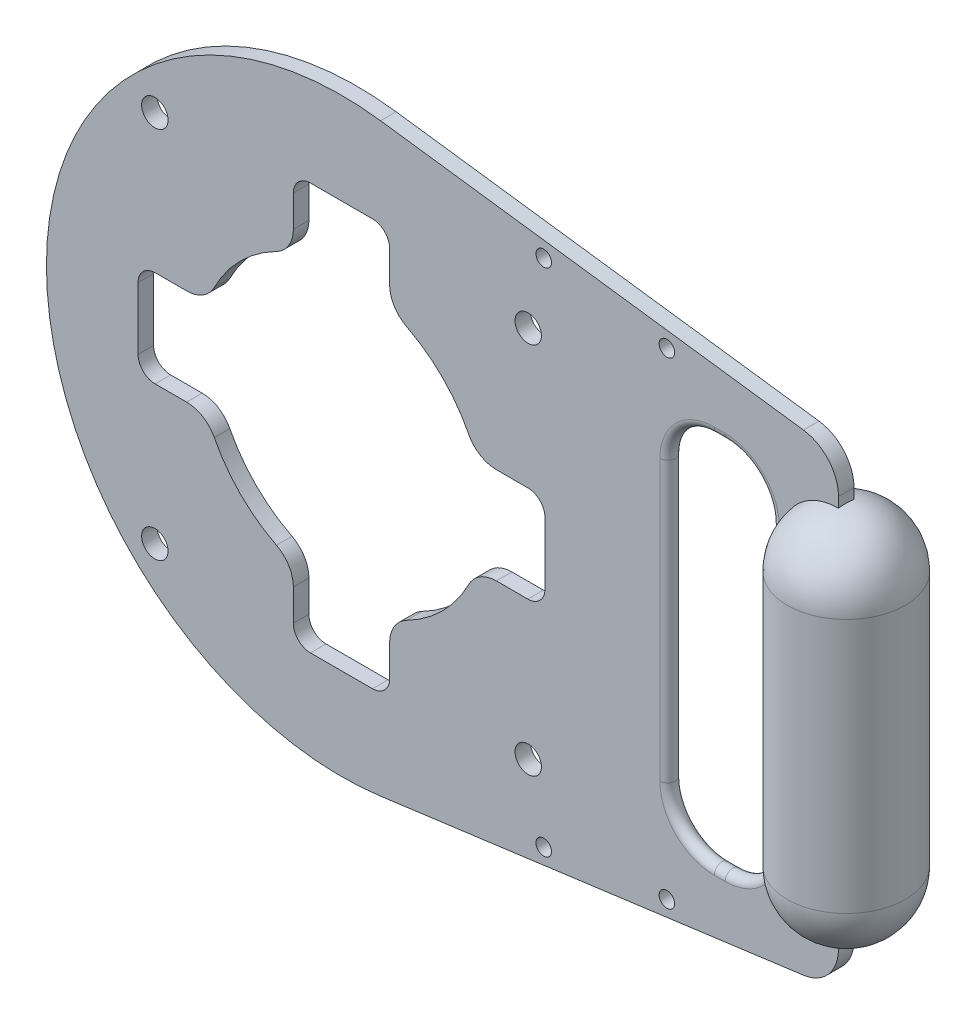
ISO-10303-21;
HEADER;
FILE_DESCRIPTION(('STEP AP214'),'2;1');
FILE_NAME('part.step','',(''),(''),'','','');
FILE_SCHEMA(('AUTOMOTIVE_DESIGN { 1 0 10303 214 1 1 1 1 }'));
ENDSEC;
DATA;
#1=APPLICATION_CONTEXT('core data for automotive mechanical design processes');
#2=APPLICATION_PROTOCOL_DEFINITION('international standard','automotive_design',2000,#1);
#3=PRODUCT_CONTEXT('',#1,'mechanical');
#4=PRODUCT('Part','Part','',(#3));
#5=PRODUCT_RELATED_PRODUCT_CATEGORY('part','',(#4));
#6=PRODUCT_DEFINITION_FORMATION('','',#4);
#7=PRODUCT_DEFINITION_CONTEXT('part definition',#1,'design');
#8=PRODUCT_DEFINITION('design','',#6,#7);
#9=PRODUCT_DEFINITION_SHAPE('','',#8);
#10=(LENGTH_UNIT() NAMED_UNIT(*) SI_UNIT(.MILLI.,.METRE.));
#11=(NAMED_UNIT(*) PLANE_ANGLE_UNIT() SI_UNIT($,.RADIAN.));
#12=(NAMED_UNIT(*) SI_UNIT($,.STERADIAN.) SOLID_ANGLE_UNIT());
#13=UNCERTAINTY_MEASURE_WITH_UNIT(LENGTH_MEASURE(1.E-05),#10,'distance_accuracy_value','');
#14=(GEOMETRIC_REPRESENTATION_CONTEXT(3) GLOBAL_UNCERTAINTY_ASSIGNED_CONTEXT((#13)) GLOBAL_UNIT_ASSIGNED_CONTEXT((#10,
#11,#12)) REPRESENTATION_CONTEXT('',''));
#15=CARTESIAN_POINT('',(0.,0.,0.));
#16=DIRECTION('',(0.,0.,1.));
#17=DIRECTION('',(1.,0.,0.));
#18=AXIS2_PLACEMENT_3D('',#15,#16,#17);
#19=CARTESIAN_POINT('',(0.,0.,5.));
#20=DIRECTION('',(0.,0.,1.));
#21=DIRECTION('',(0.,1.,0.));
#22=AXIS2_PLACEMENT_3D('',#19,#20,#21);
#23=PLANE('',#22);
#24=CARTESIAN_POINT('',(160.,59.8348082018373,5.));
#25=CARTESIAN_POINT('',(159.646831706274,59.8348194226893,5.));
#26=CARTESIAN_POINT('',(159.293664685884,59.8248753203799,5.));
#27=CARTESIAN_POINT('',(158.588464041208,59.7851581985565,5.));
#28=CARTESIAN_POINT('',(158.236430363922,59.7553861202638,5.));
#29=CARTESIAN_POINT('',(157.534599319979,59.6760954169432,5.));
#30=CARTESIAN_POINT('',(157.184801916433,59.6265771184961,5.));
#31=CARTESIAN_POINT('',(156.488806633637,59.5079993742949,5.));
#32=CARTESIAN_POINT('',(156.142606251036,59.4389546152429,5.));
#33=CARTESIAN_POINT('',(155.454629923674,59.2815241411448,5.));
#34=CARTESIAN_POINT('',(155.112853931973,59.1931386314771,5.));
#35=CARTESIAN_POINT('',(154.434826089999,58.997316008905,5.));
#36=CARTESIAN_POINT('',(154.098574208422,58.8898790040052,5.));
#37=CARTESIAN_POINT('',(153.265942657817,58.5978045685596,5.));
#38=CARTESIAN_POINT('',(152.773630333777,58.401437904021,5.));
#39=CARTESIAN_POINT('',(151.807222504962,57.9678783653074,5.));
#40=CARTESIAN_POINT('',(151.333129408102,57.7306801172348,5.));
#41=CARTESIAN_POINT('',(150.638365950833,57.3456408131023,5.));
#42=CARTESIAN_POINT('',(150.409493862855,57.2124115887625,5.));
#43=CARTESIAN_POINT('',(149.957632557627,56.9364651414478,5.));
#44=CARTESIAN_POINT('',(149.73464170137,56.793750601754,5.));
#45=CARTESIAN_POINT('',(149.074953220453,56.3516610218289,5.));
#46=CARTESIAN_POINT('',(148.647499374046,56.0383176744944,5.));
#47=CARTESIAN_POINT('',(147.820566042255,55.3767814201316,5.));
#48=CARTESIAN_POINT('',(147.421086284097,55.0285888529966,5.));
#49=CARTESIAN_POINT('',(146.652858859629,54.2997788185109,5.));
#50=CARTESIAN_POINT('',(146.284111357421,53.9191611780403,5.));
#51=CARTESIAN_POINT('',(145.579921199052,53.1281407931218,5.));
#52=CARTESIAN_POINT('',(145.244485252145,52.7177320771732,5.));
#53=CARTESIAN_POINT('',(144.609387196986,51.8701184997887,5.));
#54=CARTESIAN_POINT('',(144.309724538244,51.4329140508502,5.));
#55=CARTESIAN_POINT('',(143.748250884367,50.534736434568,5.));
#56=CARTESIAN_POINT('',(143.486446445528,50.0737591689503,5.));
#57=CARTESIAN_POINT('',(143.002597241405,49.1313507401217,5.));
#58=CARTESIAN_POINT('',(142.780554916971,48.6499183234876,5.));
#59=CARTESIAN_POINT('',(142.377932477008,47.6703120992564,5.));
#60=CARTESIAN_POINT('',(142.197331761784,47.1721467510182,5.));
#61=CARTESIAN_POINT('',(141.878762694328,46.1624467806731,5.));
#62=CARTESIAN_POINT('',(141.74078409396,45.6509154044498,5.));
#63=CARTESIAN_POINT('',(141.548281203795,44.7953951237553,5.));
#64=CARTESIAN_POINT('',(141.481366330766,44.4541399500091,5.));
#65=CARTESIAN_POINT('',(141.366523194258,43.7684549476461,5.));
#66=CARTESIAN_POINT('',(141.318593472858,43.4240253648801,5.));
#67=CARTESIAN_POINT('',(141.241929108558,42.7335617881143,5.));
#68=CARTESIAN_POINT('',(141.213165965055,42.3875309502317,5.));
#69=CARTESIAN_POINT('',(141.174790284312,41.6943347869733,5.));
#70=CARTESIAN_POINT('',(141.165181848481,41.3471692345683,5.));
#71=CARTESIAN_POINT('',(141.165191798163,41.,5.));
#72=B_SPLINE_CURVE_WITH_KNOTS('',3,(#24,#25,#26,#27,#28,#29,#30,#31,#32,#33,#34,#35,#36,#37,#38,
#39,#40,#41,#42,#43,#44,#45,#46,#47,#48,#49,#50,#51,#52,#53,#54,#55,#56,#57,#58,#59,#60,#61,#62,
#63,#64,#65,#66,#67,#68,#69,#70,#71),.UNSPECIFIED.,.F.,.F.,(4,2,2,2,2,2,2,2,2,2,2,2,2,2,2,2,2,2,
2,2,2,2,2,4),(0.,1.05936299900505,2.11867571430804,3.17797091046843,4.23647147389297,
5.29496079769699,6.35344412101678,7.94157908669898,9.52992322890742,10.3241934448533,
11.1182399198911,12.7061950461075,14.2941346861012,15.8820828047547,17.4703501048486,
19.0585929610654,20.647110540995,22.2357256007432,23.8235492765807,25.4109908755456,
26.4537699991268,27.4964690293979,28.5376140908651,29.578982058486),.UNSPECIFIED.);
#73=CARTESIAN_POINT('',(160.,59.8348082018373,5.));
#74=VERTEX_POINT('',#73);
#75=CARTESIAN_POINT('',(141.165191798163,41.,5.));
#76=VERTEX_POINT('',#75);
#77=EDGE_CURVE('E9',#74,#76,#72,.T.);
#78=ORIENTED_EDGE('',*,*,#77,.F.);
#79=DIRECTION('',(0.,-1.,0.));
#80=VECTOR('',#79,1.);
#81=CARTESIAN_POINT('',(160.,0.,5.));
#82=LINE('',#81,#80);
#83=CARTESIAN_POINT('',(160.,63.1188523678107,5.));
#84=VERTEX_POINT('',#83);
#85=EDGE_CURVE('E268',#74,#84,#82,.F.);
#86=ORIENTED_EDGE('',*,*,#85,.T.);
#87=CARTESIAN_POINT('',(147.,63.1188523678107,5.));
#88=DIRECTION('',(0.,0.,-1.));
#89=DIRECTION('',(0.,-1.,0.));
#90=AXIS2_PLACEMENT_3D('',#87,#88,#89);
#91=CIRCLE('',#90,13.);
#92=CARTESIAN_POINT('',(148.718763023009,76.004730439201,5.));
#93=VERTEX_POINT('',#92);
#94=EDGE_CURVE('E264',#93,#84,#91,.T.);
#95=ORIENTED_EDGE('',*,*,#94,.F.);
#96=DIRECTION('',(0.991221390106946,-0.132212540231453,0.));
#97=VECTOR('',#96,1.);
#98=CARTESIAN_POINT('',(12.560191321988,94.1660320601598,5.));
#99=LINE('',#98,#97);
#100=CARTESIAN_POINT('',(12.560191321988,94.1660320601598,5.));
#101=VERTEX_POINT('',#100);
#102=EDGE_CURVE('E257',#93,#101,#99,.F.);
#103=ORIENTED_EDGE('',*,*,#102,.T.);
#104=CARTESIAN_POINT('',(0.,0.,5.));
#105=DIRECTION('',(0.,0.,-1.));
#106=DIRECTION('',(0.,-1.,0.));
#107=AXIS2_PLACEMENT_3D('',#104,#105,#106);
#108=CIRCLE('',#107,95.);
#109=CARTESIAN_POINT('',(12.5601913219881,-94.1660320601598,5.));
#110=VERTEX_POINT('',#109);
#111=EDGE_CURVE('E277',#110,#101,#108,.T.);
#112=ORIENTED_EDGE('',*,*,#111,.F.);
#113=DIRECTION('',(-0.991221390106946,-0.132212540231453,0.));
#114=VECTOR('',#113,1.);
#115=CARTESIAN_POINT('',(12.5601913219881,-94.1660320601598,5.));
#116=LINE('',#115,#114);
#117=CARTESIAN_POINT('',(148.718763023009,-76.0047304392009,5.));
#118=VERTEX_POINT('',#117);
#119=EDGE_CURVE('E276',#110,#118,#116,.F.);
#120=ORIENTED_EDGE('',*,*,#119,.T.);
#121=CARTESIAN_POINT('',(147.,-63.1188523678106,5.));
#122=DIRECTION('',(0.,0.,-1.));
#123=DIRECTION('',(0.,-1.,0.));
#124=AXIS2_PLACEMENT_3D('',#121,#122,#123);
#125=CIRCLE('',#124,13.);
#126=CARTESIAN_POINT('',(160.,-63.1188523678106,5.));
#127=VERTEX_POINT('',#126);
#128=EDGE_CURVE('E272',#127,#118,#125,.T.);
#129=ORIENTED_EDGE('',*,*,#128,.F.);
#130=CARTESIAN_POINT('',(160.,-59.8348082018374,5.));
#131=VERTEX_POINT('',#130);
#132=EDGE_CURVE('E612',#127,#131,#82,.F.);
#133=ORIENTED_EDGE('',*,*,#132,.T.);
#134=CARTESIAN_POINT('',(141.165191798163,-41.,5.));
#135=CARTESIAN_POINT('',(141.165192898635,-41.318637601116,5.));
#136=CARTESIAN_POINT('',(141.173279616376,-41.6372153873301,5.));
#137=CARTESIAN_POINT('',(141.205596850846,-42.2735604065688,5.));
#138=CARTESIAN_POINT('',(141.229827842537,-42.5913276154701,5.));
#139=CARTESIAN_POINT('',(141.326775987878,-43.5431403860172,5.));
#140=CARTESIAN_POINT('',(141.423748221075,-44.1748978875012,5.));
#141=CARTESIAN_POINT('',(141.659297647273,-45.3184510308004,5.));
#142=CARTESIAN_POINT('',(141.787953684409,-45.8323239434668,5.));
#143=CARTESIAN_POINT('',(142.013014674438,-46.593606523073,5.));
#144=CARTESIAN_POINT('',(142.093398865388,-46.8458250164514,5.));
#145=CARTESIAN_POINT('',(142.264744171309,-47.3467150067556,5.));
#146=CARTESIAN_POINT('',(142.355708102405,-47.5953855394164,5.));
#147=CARTESIAN_POINT('',(142.644288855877,-48.3355098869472,5.));
#148=CARTESIAN_POINT('',(142.857559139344,-48.820956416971,5.));
#149=CARTESIAN_POINT('',(143.324263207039,-49.7721403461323,5.));
#150=CARTESIAN_POINT('',(143.577696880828,-50.2378777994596,5.));
#151=CARTESIAN_POINT('',(143.986519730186,-50.919104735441,5.));
#152=CARTESIAN_POINT('',(144.127581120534,-51.1432954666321,5.));
#153=CARTESIAN_POINT('',(144.418990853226,-51.5854735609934,5.));
#154=CARTESIAN_POINT('',(144.569336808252,-51.8034624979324,5.));
#155=CARTESIAN_POINT('',(145.034000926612,-52.4476698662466,5.));
#156=CARTESIAN_POINT('',(145.361966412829,-52.8641639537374,5.));
#157=CARTESIAN_POINT('',(146.051693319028,-53.6678793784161,5.));
#158=CARTESIAN_POINT('',(146.413445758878,-54.0551084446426,5.));
#159=CARTESIAN_POINT('',(147.168275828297,-54.797723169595,5.));
#160=CARTESIAN_POINT('',(147.561353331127,-55.1531089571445,5.));
#161=CARTESIAN_POINT('',(148.376099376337,-55.8295378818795,5.));
#162=CARTESIAN_POINT('',(148.797767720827,-56.150581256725,5.));
#163=CARTESIAN_POINT('',(149.449279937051,-56.604564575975,5.));
#164=CARTESIAN_POINT('',(149.669628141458,-56.7513007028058,5.));
#165=CARTESIAN_POINT('',(150.116374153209,-57.0353992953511,5.));
#166=CARTESIAN_POINT('',(150.342773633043,-57.1727591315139,5.));
#167=CARTESIAN_POINT('',(151.030430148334,-57.5703694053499,5.));
#168=CARTESIAN_POINT('',(151.500155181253,-57.8161575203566,5.));
#169=CARTESIAN_POINT('',(152.458569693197,-58.2672327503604,5.));
#170=CARTESIAN_POINT('',(152.947256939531,-58.4725246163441,5.));
#171=CARTESIAN_POINT('',(153.792189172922,-58.7862691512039,5.));
#172=CARTESIAN_POINT('',(154.144524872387,-58.9053524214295,5.));
#173=CARTESIAN_POINT('',(154.855662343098,-59.1224718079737,5.));
#174=CARTESIAN_POINT('',(155.214464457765,-59.2205068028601,5.));
#175=CARTESIAN_POINT('',(155.937250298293,-59.3951708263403,5.));
#176=CARTESIAN_POINT('',(156.301234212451,-59.471799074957,5.));
#177=CARTESIAN_POINT('',(157.033565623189,-59.6034636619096,5.));
#178=CARTESIAN_POINT('',(157.401918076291,-59.6584724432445,5.));
#179=CARTESIAN_POINT('',(158.141234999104,-59.7465608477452,5.));
#180=CARTESIAN_POINT('',(158.512199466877,-59.7796404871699,5.));
#181=CARTESIAN_POINT('',(159.255442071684,-59.8237712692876,5.));
#182=CARTESIAN_POINT('',(159.627720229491,-59.834822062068,5.));
#183=CARTESIAN_POINT('',(160.,-59.8348082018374,5.));
#184=B_SPLINE_CURVE_WITH_KNOTS('',3,(#134,#135,#136,#137,#138,#139,#140,#141,#142,#143,#144,
#145,#146,#147,#148,#149,#150,#151,#152,#153,#154,#155,#156,#157,#158,#159,#160,#161,#162,#163,
#164,#165,#166,#167,#168,#169,#170,#171,#172,#173,#174,#175,#176,#177,#178,#179,#180,#181,#182,
#183),.UNSPECIFIED.,.F.,.F.,(4,2,2,2,2,2,2,2,2,2,2,2,2,2,2,2,2,2,2,2,2,2,2,2,4),(0.,
0.955690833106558,1.91140978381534,3.82523423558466,5.41253371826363,6.20647504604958,
7.00062819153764,8.58930878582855,10.1779850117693,10.9724088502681,11.7666292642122,
13.3549476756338,14.942845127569,16.5307361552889,18.1186161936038,18.9126196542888,
19.7068448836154,21.2952591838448,22.883487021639,23.9986260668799,25.1138245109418,
26.229063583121,27.3457196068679,28.4623748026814,29.5790477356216),.UNSPECIFIED.);
#185=CARTESIAN_POINT('',(141.165191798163,-41.,5.));
#186=VERTEX_POINT('',#185);
#187=EDGE_CURVE('E25',#186,#131,#184,.T.);
#188=ORIENTED_EDGE('',*,*,#187,.F.);
#189=DIRECTION('',(0.,-1.,0.));
#190=VECTOR('',#189,1.);
#191=CARTESIAN_POINT('',(141.165191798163,60.,5.));
#192=LINE('',#191,#190);
#193=EDGE_CURVE('E1054',#76,#186,#192,.T.);
#194=ORIENTED_EDGE('',*,*,#193,.F.);
#195=EDGE_LOOP('',(#78,#86,#95,#103,#112,#120,#129,#133,#188,#194));
#196=FACE_BOUND('',#195,.T.);
#197=CARTESIAN_POINT('',(-60.1040764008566,-60.1040764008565,5.));
#198=DIRECTION('',(0.,0.,1.));
#199=DIRECTION('',(0.,1.,0.));
#200=AXIS2_PLACEMENT_3D('',#197,#198,#199);
#201=CIRCLE('',#200,4.25);
#202=CARTESIAN_POINT('',(-60.1040764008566,-55.8540764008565,5.));
#203=VERTEX_POINT('',#202);
#204=EDGE_CURVE('E725',#203,#203,#201,.F.);
#205=ORIENTED_EDGE('',*,*,#204,.T.);
#206=EDGE_LOOP('',(#205));
#207=FACE_BOUND('',#206,.T.);
#208=CARTESIAN_POINT('',(60.1040764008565,-60.1040764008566,5.));
#209=DIRECTION('',(0.,0.,1.));
#210=DIRECTION('',(0.,1.,0.));
#211=AXIS2_PLACEMENT_3D('',#208,#209,#210);
#212=CIRCLE('',#211,4.25);
#213=CARTESIAN_POINT('',(60.1040764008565,-55.8540764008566,5.));
#214=VERTEX_POINT('',#213);
#215=EDGE_CURVE('E728',#214,#214,#212,.F.);
#216=ORIENTED_EDGE('',*,*,#215,.T.);
#217=EDGE_LOOP('',(#216));
#218=FACE_BOUND('',#217,.T.);
#219=CARTESIAN_POINT('',(60.1040764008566,60.1040764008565,5.));
#220=DIRECTION('',(0.,0.,1.));
#221=DIRECTION('',(0.,1.,0.));
#222=AXIS2_PLACEMENT_3D('',#219,#220,#221);
#223=CIRCLE('',#222,4.25);
#224=CARTESIAN_POINT('',(60.1040764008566,64.3540764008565,5.));
#225=VERTEX_POINT('',#224);
#226=EDGE_CURVE('E731',#225,#225,#223,.F.);
#227=ORIENTED_EDGE('',*,*,#226,.T.);
#228=EDGE_LOOP('',(#227));
#229=FACE_BOUND('',#228,.T.);
#230=CARTESIAN_POINT('',(-60.1040764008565,60.1040764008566,5.));
#231=DIRECTION('',(0.,0.,1.));
#232=DIRECTION('',(0.,1.,0.));
#233=AXIS2_PLACEMENT_3D('',#230,#231,#232);
#234=CIRCLE('',#233,4.25);
#235=CARTESIAN_POINT('',(-60.1040764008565,64.3540764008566,5.));
#236=VERTEX_POINT('',#235);
#237=EDGE_CURVE('E734',#236,#236,#234,.F.);
#238=ORIENTED_EDGE('',*,*,#237,.T.);
#239=EDGE_LOOP('',(#238));
#240=FACE_BOUND('',#239,.T.);
#241=DIRECTION('',(-1.,0.,0.));
#242=VECTOR('',#241,1.);
#243=CARTESIAN_POINT('',(0.,-62.5,5.));
#244=LINE('',#243,#242);
#245=CARTESIAN_POINT('',(123.5,-62.5,5.));
#246=VERTEX_POINT('',#245);
#247=CARTESIAN_POINT('',(120.,-62.5,5.));
#248=VERTEX_POINT('',#247);
#249=EDGE_CURVE('E594',#246,#248,#244,.T.);
#250=ORIENTED_EDGE('',*,*,#249,.T.);
#251=CARTESIAN_POINT('',(120.,-45.,5.));
#252=DIRECTION('',(0.,0.,1.));
#253=DIRECTION('',(-1.,0.,0.));
#254=AXIS2_PLACEMENT_3D('',#251,#252,#253);
#255=CIRCLE('',#254,17.5);
#256=CARTESIAN_POINT('',(102.5,-45.,5.));
#257=VERTEX_POINT('',#256);
#258=EDGE_CURVE('E589',#248,#257,#255,.F.);
#259=ORIENTED_EDGE('',*,*,#258,.T.);
#260=DIRECTION('',(0.,1.,0.));
#261=VECTOR('',#260,1.);
#262=CARTESIAN_POINT('',(102.5,0.,5.));
#263=LINE('',#262,#261);
#264=CARTESIAN_POINT('',(102.5,45.,5.));
#265=VERTEX_POINT('',#264);
#266=EDGE_CURVE('E68',#257,#265,#263,.T.);
#267=ORIENTED_EDGE('',*,*,#266,.T.);
#268=CARTESIAN_POINT('',(120.,45.,5.));
#269=DIRECTION('',(0.,0.,1.));
#270=DIRECTION('',(0.,1.,0.));
#271=AXIS2_PLACEMENT_3D('',#268,#269,#270);
#272=CIRCLE('',#271,17.5);
#273=CARTESIAN_POINT('',(120.,62.5,5.));
#274=VERTEX_POINT('',#273);
#275=EDGE_CURVE('E312',#265,#274,#272,.F.);
#276=ORIENTED_EDGE('',*,*,#275,.T.);
#277=DIRECTION('',(-1.,0.,0.));
#278=VECTOR('',#277,1.);
#279=CARTESIAN_POINT('',(0.,62.5,5.));
#280=LINE('',#279,#278);
#281=CARTESIAN_POINT('',(123.5,62.5,5.));
#282=VERTEX_POINT('',#281);
#283=EDGE_CURVE('E602',#274,#282,#280,.F.);
#284=ORIENTED_EDGE('',*,*,#283,.T.);
#285=CARTESIAN_POINT('',(123.5,45.,5.));
#286=DIRECTION('',(0.,0.,1.));
#287=DIRECTION('',(1.,0.,0.));
#288=AXIS2_PLACEMENT_3D('',#285,#286,#287);
#289=CIRCLE('',#288,17.5);
#290=CARTESIAN_POINT('',(141.,45.,5.));
#291=VERTEX_POINT('',#290);
#292=EDGE_CURVE('E1226',#282,#291,#289,.F.);
#293=ORIENTED_EDGE('',*,*,#292,.T.);
#294=DIRECTION('',(0.,1.,0.));
#295=VECTOR('',#294,1.);
#296=CARTESIAN_POINT('',(141.,0.,5.));
#297=LINE('',#296,#295);
#298=CARTESIAN_POINT('',(141.,-45.,5.));
#299=VERTEX_POINT('',#298);
#300=EDGE_CURVE('E1220',#291,#299,#297,.F.);
#301=ORIENTED_EDGE('',*,*,#300,.T.);
#302=CARTESIAN_POINT('',(123.5,-45.,5.));
#303=DIRECTION('',(0.,0.,1.));
#304=DIRECTION('',(0.,-1.,0.));
#305=AXIS2_PLACEMENT_3D('',#302,#303,#304);
#306=CIRCLE('',#305,17.5);
#307=EDGE_CURVE('E384',#299,#246,#306,.F.);
#308=ORIENTED_EDGE('',*,*,#307,.T.);
#309=EDGE_LOOP('',(#250,#259,#267,#276,#284,#293,#301,#308));
#310=FACE_BOUND('',#309,.T.);
#311=DIRECTION('',(1.,0.,0.));
#312=VECTOR('',#311,1.);
#313=CARTESIAN_POINT('',(0.,-15.5,5.));
#314=LINE('',#313,#312);
#315=CARTESIAN_POINT('',(-49.8572963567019,-15.5,5.));
#316=VERTEX_POINT('',#315);
#317=CARTESIAN_POINT('',(-60.,-15.5,5.));
#318=VERTEX_POINT('',#317);
#319=EDGE_CURVE('E435',#316,#318,#314,.F.);
#320=ORIENTED_EDGE('',*,*,#319,.T.);
#321=CARTESIAN_POINT('',(-60.,-10.,5.));
#322=DIRECTION('',(0.,0.,1.));
#323=DIRECTION('',(0.,1.,0.));
#324=AXIS2_PLACEMENT_3D('',#321,#322,#323);
#325=CIRCLE('',#324,5.5);
#326=CARTESIAN_POINT('',(-65.5,-10.,5.));
#327=VERTEX_POINT('',#326);
#328=EDGE_CURVE('E431',#318,#327,#325,.F.);
#329=ORIENTED_EDGE('',*,*,#328,.T.);
#330=DIRECTION('',(0.,-1.,0.));
#331=VECTOR('',#330,1.);
#332=CARTESIAN_POINT('',(-65.5,0.,5.));
#333=LINE('',#332,#331);
#334=CARTESIAN_POINT('',(-65.5,10.,5.));
#335=VERTEX_POINT('',#334);
#336=EDGE_CURVE('E427',#327,#335,#333,.F.);
#337=ORIENTED_EDGE('',*,*,#336,.T.);
#338=CARTESIAN_POINT('',(-60.,10.,5.));
#339=DIRECTION('',(0.,0.,1.));
#340=DIRECTION('',(0.,1.,0.));
#341=AXIS2_PLACEMENT_3D('',#338,#339,#340);
#342=CIRCLE('',#341,5.5);
#343=CARTESIAN_POINT('',(-60.,15.5,5.));
#344=VERTEX_POINT('',#343);
#345=EDGE_CURVE('E423',#335,#344,#342,.F.);
#346=ORIENTED_EDGE('',*,*,#345,.T.);
#347=DIRECTION('',(-1.,0.,0.));
#348=VECTOR('',#347,1.);
#349=CARTESIAN_POINT('',(0.,15.5,5.));
#350=LINE('',#349,#348);
#351=CARTESIAN_POINT('',(-49.8572963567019,15.5,5.));
#352=VERTEX_POINT('',#351);
#353=EDGE_CURVE('E616',#344,#352,#350,.F.);
#354=ORIENTED_EDGE('',*,*,#353,.T.);
#355=CARTESIAN_POINT('',(-49.8572963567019,25.5,5.));
#356=DIRECTION('',(0.,0.,-1.));
#357=DIRECTION('',(0.,-1.,0.));
#358=AXIS2_PLACEMENT_3D('',#355,#356,#357);
#359=CIRCLE('',#358,10.);
#360=CARTESIAN_POINT('',(-40.9542077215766,20.9464285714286,5.));
#361=VERTEX_POINT('',#360);
#362=EDGE_CURVE('E546',#361,#352,#359,.T.);
#363=ORIENTED_EDGE('',*,*,#362,.F.);
#364=CARTESIAN_POINT('',(0.,0.,5.));
#365=DIRECTION('',(0.,0.,-1.));
#366=DIRECTION('',(0.,-1.,0.));
#367=AXIS2_PLACEMENT_3D('',#364,#365,#366);
#368=CIRCLE('',#367,46.);
#369=CARTESIAN_POINT('',(-20.9464285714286,40.9542077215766,5.));
#370=VERTEX_POINT('',#369);
#371=EDGE_CURVE('E542',#361,#370,#368,.T.);
#372=ORIENTED_EDGE('',*,*,#371,.T.);
#373=CARTESIAN_POINT('',(-25.5,49.8572963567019,5.));
#374=DIRECTION('',(0.,0.,-1.));
#375=DIRECTION('',(0.,-1.,0.));
#376=AXIS2_PLACEMENT_3D('',#373,#374,#375);
#377=CIRCLE('',#376,10.);
#378=CARTESIAN_POINT('',(-15.5,49.8572963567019,5.));
#379=VERTEX_POINT('',#378);
#380=EDGE_CURVE('E538',#379,#370,#377,.T.);
#381=ORIENTED_EDGE('',*,*,#380,.F.);
#382=DIRECTION('',(0.,-1.,0.));
#383=VECTOR('',#382,1.);
#384=CARTESIAN_POINT('',(-15.5,0.,5.));
#385=LINE('',#384,#383);
#386=CARTESIAN_POINT('',(-15.5,60.,5.));
#387=VERTEX_POINT('',#386);
#388=EDGE_CURVE('E531',#379,#387,#385,.F.);
#389=ORIENTED_EDGE('',*,*,#388,.T.);
#390=CARTESIAN_POINT('',(-10.,60.,5.));
#391=DIRECTION('',(0.,0.,1.));
#392=DIRECTION('',(0.,1.,0.));
#393=AXIS2_PLACEMENT_3D('',#390,#391,#392);
#394=CIRCLE('',#393,5.5);
#395=CARTESIAN_POINT('',(-10.,65.5,5.));
#396=VERTEX_POINT('',#395);
#397=EDGE_CURVE('E527',#387,#396,#394,.F.);
#398=ORIENTED_EDGE('',*,*,#397,.T.);
#399=DIRECTION('',(-1.,0.,0.));
#400=VECTOR('',#399,1.);
#401=CARTESIAN_POINT('',(0.,65.5,5.));
#402=LINE('',#401,#400);
#403=CARTESIAN_POINT('',(10.,65.5,5.));
#404=VERTEX_POINT('',#403);
#405=EDGE_CURVE('E523',#396,#404,#402,.F.);
#406=ORIENTED_EDGE('',*,*,#405,.T.);
#407=CARTESIAN_POINT('',(10.,60.,5.));
#408=DIRECTION('',(0.,0.,1.));
#409=DIRECTION('',(0.,1.,0.));
#410=AXIS2_PLACEMENT_3D('',#407,#408,#409);
#411=CIRCLE('',#410,5.5);
#412=CARTESIAN_POINT('',(15.5,60.,5.));
#413=VERTEX_POINT('',#412);
#414=EDGE_CURVE('E519',#404,#413,#411,.F.);
#415=ORIENTED_EDGE('',*,*,#414,.T.);
#416=DIRECTION('',(0.,1.,0.));
#417=VECTOR('',#416,1.);
#418=CARTESIAN_POINT('',(15.5,0.,5.));
#419=LINE('',#418,#417);
#420=CARTESIAN_POINT('',(15.5,49.8572963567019,5.));
#421=VERTEX_POINT('',#420);
#422=EDGE_CURVE('E518',#413,#421,#419,.F.);
#423=ORIENTED_EDGE('',*,*,#422,.T.);
#424=CARTESIAN_POINT('',(25.5,49.8572963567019,5.));
#425=DIRECTION('',(0.,0.,-1.));
#426=DIRECTION('',(0.,-1.,0.));
#427=AXIS2_PLACEMENT_3D('',#424,#425,#426);
#428=CIRCLE('',#427,10.);
#429=CARTESIAN_POINT('',(20.9464285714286,40.9542077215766,5.));
#430=VERTEX_POINT('',#429);
#431=EDGE_CURVE('E514',#430,#421,#428,.T.);
#432=ORIENTED_EDGE('',*,*,#431,.F.);
#433=CARTESIAN_POINT('',(0.,0.,5.));
#434=DIRECTION('',(0.,0.,-1.));
#435=DIRECTION('',(0.,-1.,0.));
#436=AXIS2_PLACEMENT_3D('',#433,#434,#435);
#437=CIRCLE('',#436,46.);
#438=CARTESIAN_POINT('',(40.9542077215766,20.9464285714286,5.));
#439=VERTEX_POINT('',#438);
#440=EDGE_CURVE('E510',#430,#439,#437,.T.);
#441=ORIENTED_EDGE('',*,*,#440,.T.);
#442=CARTESIAN_POINT('',(49.8572963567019,25.5,5.));
#443=DIRECTION('',(0.,0.,-1.));
#444=DIRECTION('',(0.,-1.,0.));
#445=AXIS2_PLACEMENT_3D('',#442,#443,#444);
#446=CIRCLE('',#445,10.);
#447=CARTESIAN_POINT('',(49.8572963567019,15.5,5.));
#448=VERTEX_POINT('',#447);
#449=EDGE_CURVE('E506',#448,#439,#446,.T.);
#450=ORIENTED_EDGE('',*,*,#449,.F.);
#451=DIRECTION('',(-1.,0.,0.));
#452=VECTOR('',#451,1.);
#453=CARTESIAN_POINT('',(0.,15.5,5.));
#454=LINE('',#453,#452);
#455=CARTESIAN_POINT('',(60.,15.5,5.));
#456=VERTEX_POINT('',#455);
#457=EDGE_CURVE('E499',#448,#456,#454,.F.);
#458=ORIENTED_EDGE('',*,*,#457,.T.);
#459=CARTESIAN_POINT('',(60.,10.,5.));
#460=DIRECTION('',(0.,0.,1.));
#461=DIRECTION('',(0.,1.,0.));
#462=AXIS2_PLACEMENT_3D('',#459,#460,#461);
#463=CIRCLE('',#462,5.5);
#464=CARTESIAN_POINT('',(65.5,10.,5.));
#465=VERTEX_POINT('',#464);
#466=EDGE_CURVE('E495',#456,#465,#463,.F.);
#467=ORIENTED_EDGE('',*,*,#466,.T.);
#468=DIRECTION('',(0.,1.,0.));
#469=VECTOR('',#468,1.);
#470=CARTESIAN_POINT('',(65.5,0.,5.));
#471=LINE('',#470,#469);
#472=CARTESIAN_POINT('',(65.5,-10.,5.));
#473=VERTEX_POINT('',#472);
#474=EDGE_CURVE('E491',#465,#473,#471,.F.);
#475=ORIENTED_EDGE('',*,*,#474,.T.);
#476=CARTESIAN_POINT('',(60.,-10.,5.));
#477=DIRECTION('',(0.,0.,1.));
#478=DIRECTION('',(0.,1.,0.));
#479=AXIS2_PLACEMENT_3D('',#476,#477,#478);
#480=CIRCLE('',#479,5.5);
#481=CARTESIAN_POINT('',(60.,-15.5,5.));
#482=VERTEX_POINT('',#481);
#483=EDGE_CURVE('E487',#473,#482,#480,.F.);
#484=ORIENTED_EDGE('',*,*,#483,.T.);
#485=DIRECTION('',(1.,0.,0.));
#486=VECTOR('',#485,1.);
#487=CARTESIAN_POINT('',(0.,-15.5,5.));
#488=LINE('',#487,#486);
#489=CARTESIAN_POINT('',(49.8572963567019,-15.5,5.));
#490=VERTEX_POINT('',#489);
#491=EDGE_CURVE('E486',#482,#490,#488,.F.);
#492=ORIENTED_EDGE('',*,*,#491,.T.);
#493=CARTESIAN_POINT('',(49.8572963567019,-25.5,5.));
#494=DIRECTION('',(0.,0.,-1.));
#495=DIRECTION('',(0.,-1.,0.));
#496=AXIS2_PLACEMENT_3D('',#493,#494,#495);
#497=CIRCLE('',#496,10.);
#498=CARTESIAN_POINT('',(40.9542077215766,-20.9464285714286,5.));
#499=VERTEX_POINT('',#498);
#500=EDGE_CURVE('E482',#499,#490,#497,.T.);
#501=ORIENTED_EDGE('',*,*,#500,.F.);
#502=CARTESIAN_POINT('',(0.,0.,5.));
#503=DIRECTION('',(0.,0.,-1.));
#504=DIRECTION('',(0.,-1.,0.));
#505=AXIS2_PLACEMENT_3D('',#502,#503,#504);
#506=CIRCLE('',#505,46.);
#507=CARTESIAN_POINT('',(20.9464285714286,-40.9542077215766,5.));
#508=VERTEX_POINT('',#507);
#509=EDGE_CURVE('E478',#499,#508,#506,.T.);
#510=ORIENTED_EDGE('',*,*,#509,.T.);
#511=CARTESIAN_POINT('',(25.5,-49.8572963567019,5.));
#512=DIRECTION('',(0.,0.,-1.));
#513=DIRECTION('',(0.,-1.,0.));
#514=AXIS2_PLACEMENT_3D('',#511,#512,#513);
#515=CIRCLE('',#514,10.);
#516=CARTESIAN_POINT('',(15.5,-49.8572963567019,5.));
#517=VERTEX_POINT('',#516);
#518=EDGE_CURVE('E474',#517,#508,#515,.T.);
#519=ORIENTED_EDGE('',*,*,#518,.F.);
#520=DIRECTION('',(0.,1.,0.));
#521=VECTOR('',#520,1.);
#522=CARTESIAN_POINT('',(15.5,0.,5.));
#523=LINE('',#522,#521);
#524=CARTESIAN_POINT('',(15.5,-60.,5.));
#525=VERTEX_POINT('',#524);
#526=EDGE_CURVE('E467',#517,#525,#523,.F.);
#527=ORIENTED_EDGE('',*,*,#526,.T.);
#528=CARTESIAN_POINT('',(10.,-60.,5.));
#529=DIRECTION('',(0.,0.,1.));
#530=DIRECTION('',(0.,1.,0.));
#531=AXIS2_PLACEMENT_3D('',#528,#529,#530);
#532=CIRCLE('',#531,5.5);
#533=CARTESIAN_POINT('',(10.,-65.5,5.));
#534=VERTEX_POINT('',#533);
#535=EDGE_CURVE('E463',#525,#534,#532,.F.);
#536=ORIENTED_EDGE('',*,*,#535,.T.);
#537=DIRECTION('',(-1.,0.,0.));
#538=VECTOR('',#537,1.);
#539=CARTESIAN_POINT('',(0.,-65.5,5.));
#540=LINE('',#539,#538);
#541=CARTESIAN_POINT('',(-10.,-65.5,5.));
#542=VERTEX_POINT('',#541);
#543=EDGE_CURVE('E459',#534,#542,#540,.T.);
#544=ORIENTED_EDGE('',*,*,#543,.T.);
#545=CARTESIAN_POINT('',(-10.,-60.,5.));
#546=DIRECTION('',(0.,0.,1.));
#547=DIRECTION('',(0.,1.,0.));
#548=AXIS2_PLACEMENT_3D('',#545,#546,#547);
#549=CIRCLE('',#548,5.5);
#550=CARTESIAN_POINT('',(-15.5,-60.,5.));
#551=VERTEX_POINT('',#550);
#552=EDGE_CURVE('E455',#542,#551,#549,.F.);
#553=ORIENTED_EDGE('',*,*,#552,.T.);
#554=DIRECTION('',(0.,-1.,0.));
#555=VECTOR('',#554,1.);
#556=CARTESIAN_POINT('',(-15.5,0.,5.));
#557=LINE('',#556,#555);
#558=CARTESIAN_POINT('',(-15.5,-49.8572963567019,5.));
#559=VERTEX_POINT('',#558);
#560=EDGE_CURVE('E454',#551,#559,#557,.F.);
#561=ORIENTED_EDGE('',*,*,#560,.T.);
#562=CARTESIAN_POINT('',(-25.5,-49.8572963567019,5.));
#563=DIRECTION('',(0.,0.,-1.));
#564=DIRECTION('',(0.,-1.,0.));
#565=AXIS2_PLACEMENT_3D('',#562,#563,#564);
#566=CIRCLE('',#565,10.);
#567=CARTESIAN_POINT('',(-20.9464285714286,-40.9542077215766,5.));
#568=VERTEX_POINT('',#567);
#569=EDGE_CURVE('E450',#568,#559,#566,.T.);
#570=ORIENTED_EDGE('',*,*,#569,.F.);
#571=CARTESIAN_POINT('',(0.,0.,5.));
#572=DIRECTION('',(0.,0.,-1.));
#573=DIRECTION('',(0.,-1.,0.));
#574=AXIS2_PLACEMENT_3D('',#571,#572,#573);
#575=CIRCLE('',#574,46.);
#576=CARTESIAN_POINT('',(-40.9542077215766,-20.9464285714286,5.));
#577=VERTEX_POINT('',#576);
#578=EDGE_CURVE('E446',#568,#577,#575,.T.);
#579=ORIENTED_EDGE('',*,*,#578,.T.);
#580=CARTESIAN_POINT('',(-49.8572963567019,-25.5,5.));
#581=DIRECTION('',(0.,0.,-1.));
#582=DIRECTION('',(0.,-1.,0.));
#583=AXIS2_PLACEMENT_3D('',#580,#581,#582);
#584=CIRCLE('',#583,10.);
#585=EDGE_CURVE('E442',#316,#577,#584,.T.);
#586=ORIENTED_EDGE('',*,*,#585,.F.);
#587=EDGE_LOOP('',(#320,#329,#337,#346,#354,#363,#372,#381,#389,#398,#406,#415,#423,#432,#441,
#450,#458,#467,#475,#484,#492,#501,#510,#519,#527,#536,#544,#553,#561,#570,#579,#586));
#588=FACE_BOUND('',#587,.T.);
#589=CARTESIAN_POINT('',(65.1040764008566,82.113265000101,5.));
#590=DIRECTION('',(0.,0.,1.));
#591=DIRECTION('',(0.,1.,0.));
#592=AXIS2_PLACEMENT_3D('',#589,#590,#591);
#593=CIRCLE('',#592,2.5);
#594=CARTESIAN_POINT('',(65.1040764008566,84.613265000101,5.));
#595=VERTEX_POINT('',#594);
#596=EDGE_CURVE('E619',#595,#595,#593,.F.);
#597=ORIENTED_EDGE('',*,*,#596,.T.);
#598=EDGE_LOOP('',(#597));
#599=FACE_BOUND('',#598,.T.);
#600=CARTESIAN_POINT('',(104.752932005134,76.8247633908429,5.));
#601=DIRECTION('',(0.,0.,1.));
#602=DIRECTION('',(0.,1.,0.));
#603=AXIS2_PLACEMENT_3D('',#600,#601,#602);
#604=CIRCLE('',#603,2.5);
#605=CARTESIAN_POINT('',(104.752932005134,79.3247633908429,5.));
#606=VERTEX_POINT('',#605);
#607=EDGE_CURVE('E779',#606,#606,#604,.F.);
#608=ORIENTED_EDGE('',*,*,#607,.T.);
#609=EDGE_LOOP('',(#608));
#610=FACE_BOUND('',#609,.T.);
#611=CARTESIAN_POINT('',(104.752932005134,-76.8247633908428,5.));
#612=DIRECTION('',(0.,0.,1.));
#613=DIRECTION('',(0.,1.,0.));
#614=AXIS2_PLACEMENT_3D('',#611,#612,#613);
#615=CIRCLE('',#614,2.5);
#616=CARTESIAN_POINT('',(104.752932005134,-74.3247633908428,5.));
#617=VERTEX_POINT('',#616);
#618=EDGE_CURVE('E782',#617,#617,#615,.F.);
#619=ORIENTED_EDGE('',*,*,#618,.T.);
#620=EDGE_LOOP('',(#619));
#621=FACE_BOUND('',#620,.T.);
#622=CARTESIAN_POINT('',(65.1040764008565,-82.1132650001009,5.));
#623=DIRECTION('',(0.,0.,1.));
#624=DIRECTION('',(0.,1.,0.));
#625=AXIS2_PLACEMENT_3D('',#622,#623,#624);
#626=CIRCLE('',#625,2.5);
#627=CARTESIAN_POINT('',(65.1040764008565,-79.6132650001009,5.));
#628=VERTEX_POINT('',#627);
#629=EDGE_CURVE('E596',#628,#628,#626,.F.);
#630=ORIENTED_EDGE('',*,*,#629,.T.);
#631=EDGE_LOOP('',(#630));
#632=FACE_BOUND('',#631,.T.);
#633=ADVANCED_FACE('F14',(#196,#207,#218,#229,#240,#310,#588,#599,#610,#621,#632),#23,.T.);
#634=CARTESIAN_POINT('',(65.1040764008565,-82.1132650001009,5.));
#635=DIRECTION('',(0.,0.,1.));
#636=DIRECTION('',(0.,1.,0.));
#637=AXIS2_PLACEMENT_3D('',#634,#635,#636);
#638=CYLINDRICAL_SURFACE('',#637,2.5);
#639=CARTESIAN_POINT('',(65.1040764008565,-82.1132650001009,0.));
#640=DIRECTION('',(0.,0.,1.));
#641=DIRECTION('',(0.,1.,0.));
#642=AXIS2_PLACEMENT_3D('',#639,#640,#641);
#643=CIRCLE('',#642,2.5);
#644=CARTESIAN_POINT('',(65.1040764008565,-79.6132650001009,0.));
#645=VERTEX_POINT('',#644);
#646=EDGE_CURVE('E611',#645,#645,#643,.F.);
#647=ORIENTED_EDGE('',*,*,#646,.T.);
#648=EDGE_LOOP('',(#647));
#649=FACE_BOUND('',#648,.T.);
#650=ORIENTED_EDGE('',*,*,#629,.F.);
#651=EDGE_LOOP('',(#650));
#652=FACE_BOUND('',#651,.T.);
#653=ADVANCED_FACE('F564',(#649,#652),#638,.F.);
#654=CARTESIAN_POINT('',(104.752932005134,-76.8247633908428,5.));
#655=DIRECTION('',(0.,0.,1.));
#656=DIRECTION('',(0.,1.,0.));
#657=AXIS2_PLACEMENT_3D('',#654,#655,#656);
#658=CYLINDRICAL_SURFACE('',#657,2.5);
#659=CARTESIAN_POINT('',(104.752932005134,-76.8247633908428,0.));
#660=DIRECTION('',(0.,0.,1.));
#661=DIRECTION('',(0.,1.,0.));
#662=AXIS2_PLACEMENT_3D('',#659,#660,#661);
#663=CIRCLE('',#662,2.5);
#664=CARTESIAN_POINT('',(104.752932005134,-74.3247633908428,0.));
#665=VERTEX_POINT('',#664);
#666=EDGE_CURVE('E714',#665,#665,#663,.F.);
#667=ORIENTED_EDGE('',*,*,#666,.T.);
#668=EDGE_LOOP('',(#667));
#669=FACE_BOUND('',#668,.T.);
#670=ORIENTED_EDGE('',*,*,#618,.F.);
#671=EDGE_LOOP('',(#670));
#672=FACE_BOUND('',#671,.T.);
#673=ADVANCED_FACE('F789',(#669,#672),#658,.F.);
#674=CARTESIAN_POINT('',(104.752932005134,76.8247633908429,5.));
#675=DIRECTION('',(0.,0.,1.));
#676=DIRECTION('',(0.,1.,0.));
#677=AXIS2_PLACEMENT_3D('',#674,#675,#676);
#678=CYLINDRICAL_SURFACE('',#677,2.5);
#679=CARTESIAN_POINT('',(104.752932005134,76.8247633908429,0.));
#680=DIRECTION('',(0.,0.,1.));
#681=DIRECTION('',(0.,1.,0.));
#682=AXIS2_PLACEMENT_3D('',#679,#680,#681);
#683=CIRCLE('',#682,2.5);
#684=CARTESIAN_POINT('',(104.752932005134,79.3247633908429,0.));
#685=VERTEX_POINT('',#684);
#686=EDGE_CURVE('E711',#685,#685,#683,.F.);
#687=ORIENTED_EDGE('',*,*,#686,.T.);
#688=EDGE_LOOP('',(#687));
#689=FACE_BOUND('',#688,.T.);
#690=ORIENTED_EDGE('',*,*,#607,.F.);
#691=EDGE_LOOP('',(#690));
#692=FACE_BOUND('',#691,.T.);
#693=ADVANCED_FACE('F795',(#689,#692),#678,.F.);
#694=CARTESIAN_POINT('',(65.1040764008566,82.113265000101,5.));
#695=DIRECTION('',(0.,0.,1.));
#696=DIRECTION('',(0.,1.,0.));
#697=AXIS2_PLACEMENT_3D('',#694,#695,#696);
#698=CYLINDRICAL_SURFACE('',#697,2.5);
#699=CARTESIAN_POINT('',(65.1040764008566,82.113265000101,0.));
#700=DIRECTION('',(0.,0.,1.));
#701=DIRECTION('',(0.,1.,0.));
#702=AXIS2_PLACEMENT_3D('',#699,#700,#701);
#703=CIRCLE('',#702,2.5);
#704=CARTESIAN_POINT('',(65.1040764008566,84.613265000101,0.));
#705=VERTEX_POINT('',#704);
#706=EDGE_CURVE('E253',#705,#705,#703,.F.);
#707=ORIENTED_EDGE('',*,*,#706,.T.);
#708=EDGE_LOOP('',(#707));
#709=FACE_BOUND('',#708,.T.);
#710=ORIENTED_EDGE('',*,*,#596,.F.);
#711=EDGE_LOOP('',(#710));
#712=FACE_BOUND('',#711,.T.);
#713=ADVANCED_FACE('F802',(#709,#712),#698,.F.);
#714=CARTESIAN_POINT('',(-60.,10.,-0.00100000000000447));
#715=DIRECTION('',(0.,0.,1.));
#716=DIRECTION('',(0.,1.,0.));
#717=AXIS2_PLACEMENT_3D('',#714,#715,#716);
#718=CYLINDRICAL_SURFACE('',#717,5.5);
#719=DIRECTION('',(0.,0.,1.));
#720=VECTOR('',#719,1.);
#721=CARTESIAN_POINT('',(-60.,15.5,-0.00100000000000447));
#722=LINE('',#721,#720);
#723=CARTESIAN_POINT('',(-60.,15.5,0.));
#724=VERTEX_POINT('',#723);
#725=EDGE_CURVE('E418',#344,#724,#722,.F.);
#726=ORIENTED_EDGE('',*,*,#725,.F.);
#727=ORIENTED_EDGE('',*,*,#345,.F.);
#728=DIRECTION('',(0.,0.,1.));
#729=VECTOR('',#728,1.);
#730=CARTESIAN_POINT('',(-65.5,10.,-0.00100000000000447));
#731=LINE('',#730,#729);
#732=CARTESIAN_POINT('',(-65.5,10.,0.));
#733=VERTEX_POINT('',#732);
#734=EDGE_CURVE('E424',#733,#335,#731,.T.);
#735=ORIENTED_EDGE('',*,*,#734,.F.);
#736=CARTESIAN_POINT('',(-60.,10.,0.));
#737=DIRECTION('',(0.,0.,1.));
#738=DIRECTION('',(0.,1.,0.));
#739=AXIS2_PLACEMENT_3D('',#736,#737,#738);
#740=CIRCLE('',#739,5.5);
#741=EDGE_CURVE('E199',#733,#724,#740,.F.);
#742=ORIENTED_EDGE('',*,*,#741,.T.);
#743=EDGE_LOOP('',(#726,#727,#735,#742));
#744=FACE_BOUND('',#743,.T.);
#745=ADVANCED_FACE('F809',(#744),#718,.F.);
#746=CARTESIAN_POINT('',(0.,15.5,-0.00100000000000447));
#747=DIRECTION('',(0.,1.,0.));
#748=DIRECTION('',(-1.,0.,0.));
#749=AXIS2_PLACEMENT_3D('',#746,#747,#748);
#750=PLANE('',#749);
#751=DIRECTION('',(0.,0.,-1.));
#752=VECTOR('',#751,1.);
#753=CARTESIAN_POINT('',(-49.8572963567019,15.5,5.));
#754=LINE('',#753,#752);
#755=CARTESIAN_POINT('',(-49.8572963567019,15.5,0.));
#756=VERTEX_POINT('',#755);
#757=EDGE_CURVE('E543',#352,#756,#754,.T.);
#758=ORIENTED_EDGE('',*,*,#757,.F.);
#759=ORIENTED_EDGE('',*,*,#353,.F.);
#760=ORIENTED_EDGE('',*,*,#725,.T.);
#761=DIRECTION('',(-1.,0.,0.));
#762=VECTOR('',#761,1.);
#763=CARTESIAN_POINT('',(0.,15.5,0.));
#764=LINE('',#763,#762);
#765=EDGE_CURVE('E249',#724,#756,#764,.F.);
#766=ORIENTED_EDGE('',*,*,#765,.T.);
#767=EDGE_LOOP('',(#758,#759,#760,#766));
#768=FACE_BOUND('',#767,.T.);
#769=ADVANCED_FACE('F811',(#768),#750,.F.);
#770=CARTESIAN_POINT('',(-49.8572963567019,25.5,5.));
#771=DIRECTION('',(0.,0.,-1.));
#772=DIRECTION('',(0.,-1.,0.));
#773=AXIS2_PLACEMENT_3D('',#770,#771,#772);
#774=CYLINDRICAL_SURFACE('',#773,10.);
#775=ORIENTED_EDGE('',*,*,#362,.T.);
#776=ORIENTED_EDGE('',*,*,#757,.T.);
#777=CARTESIAN_POINT('',(-49.8572963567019,25.5,0.));
#778=DIRECTION('',(0.,0.,-1.));
#779=DIRECTION('',(0.,-1.,0.));
#780=AXIS2_PLACEMENT_3D('',#777,#778,#779);
#781=CIRCLE('',#780,10.);
#782=CARTESIAN_POINT('',(-40.9542077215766,20.9464285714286,0.));
#783=VERTEX_POINT('',#782);
#784=EDGE_CURVE('E252',#756,#783,#781,.F.);
#785=ORIENTED_EDGE('',*,*,#784,.T.);
#786=DIRECTION('',(0.,0.,-1.));
#787=VECTOR('',#786,1.);
#788=CARTESIAN_POINT('',(-40.9542077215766,20.9464285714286,5.));
#789=LINE('',#788,#787);
#790=EDGE_CURVE('E539',#783,#361,#789,.F.);
#791=ORIENTED_EDGE('',*,*,#790,.T.);
#792=EDGE_LOOP('',(#775,#776,#785,#791));
#793=FACE_BOUND('',#792,.T.);
#794=ADVANCED_FACE('F814',(#793),#774,.T.);
#795=CARTESIAN_POINT('',(0.,0.,5.));
#796=DIRECTION('',(0.,0.,-1.));
#797=DIRECTION('',(0.,-1.,0.));
#798=AXIS2_PLACEMENT_3D('',#795,#796,#797);
#799=CYLINDRICAL_SURFACE('',#798,46.);
#800=ORIENTED_EDGE('',*,*,#790,.F.);
#801=CARTESIAN_POINT('',(0.,0.,0.));
#802=DIRECTION('',(0.,0.,-1.));
#803=DIRECTION('',(0.,-1.,0.));
#804=AXIS2_PLACEMENT_3D('',#801,#802,#803);
#805=CIRCLE('',#804,46.);
#806=CARTESIAN_POINT('',(-20.9464285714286,40.9542077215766,0.));
#807=VERTEX_POINT('',#806);
#808=EDGE_CURVE('E704',#783,#807,#805,.T.);
#809=ORIENTED_EDGE('',*,*,#808,.T.);
#810=DIRECTION('',(0.,0.,-1.));
#811=VECTOR('',#810,1.);
#812=CARTESIAN_POINT('',(-20.9464285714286,40.9542077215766,5.));
#813=LINE('',#812,#811);
#814=EDGE_CURVE('E535',#370,#807,#813,.T.);
#815=ORIENTED_EDGE('',*,*,#814,.F.);
#816=ORIENTED_EDGE('',*,*,#371,.F.);
#817=EDGE_LOOP('',(#800,#809,#815,#816));
#818=FACE_BOUND('',#817,.T.);
#819=ADVANCED_FACE('F818',(#818),#799,.F.);
#820=CARTESIAN_POINT('',(-25.5,49.8572963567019,5.));
#821=DIRECTION('',(0.,0.,-1.));
#822=DIRECTION('',(0.,-1.,0.));
#823=AXIS2_PLACEMENT_3D('',#820,#821,#822);
#824=CYLINDRICAL_SURFACE('',#823,10.);
#825=ORIENTED_EDGE('',*,*,#380,.T.);
#826=ORIENTED_EDGE('',*,*,#814,.T.);
#827=CARTESIAN_POINT('',(-25.5,49.8572963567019,0.));
#828=DIRECTION('',(0.,0.,-1.));
#829=DIRECTION('',(0.,-1.,0.));
#830=AXIS2_PLACEMENT_3D('',#827,#828,#829);
#831=CIRCLE('',#830,10.);
#832=CARTESIAN_POINT('',(-15.5,49.8572963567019,0.));
#833=VERTEX_POINT('',#832);
#834=EDGE_CURVE('E248',#807,#833,#831,.F.);
#835=ORIENTED_EDGE('',*,*,#834,.T.);
#836=DIRECTION('',(0.,0.,1.));
#837=VECTOR('',#836,1.);
#838=CARTESIAN_POINT('',(-15.5,49.8572963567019,-0.00100000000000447));
#839=LINE('',#838,#837);
#840=EDGE_CURVE('E532',#833,#379,#839,.T.);
#841=ORIENTED_EDGE('',*,*,#840,.T.);
#842=EDGE_LOOP('',(#825,#826,#835,#841));
#843=FACE_BOUND('',#842,.T.);
#844=ADVANCED_FACE('F822',(#843),#824,.T.);
#845=CARTESIAN_POINT('',(-15.5,0.,-0.00100000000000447));
#846=DIRECTION('',(-1.,0.,0.));
#847=DIRECTION('',(0.,-1.,0.));
#848=AXIS2_PLACEMENT_3D('',#845,#846,#847);
#849=PLANE('',#848);
#850=ORIENTED_EDGE('',*,*,#840,.F.);
#851=DIRECTION('',(0.,1.,0.));
#852=VECTOR('',#851,1.);
#853=CARTESIAN_POINT('',(-15.5,0.,0.));
#854=LINE('',#853,#852);
#855=CARTESIAN_POINT('',(-15.5,60.,0.));
#856=VERTEX_POINT('',#855);
#857=EDGE_CURVE('E245',#833,#856,#854,.T.);
#858=ORIENTED_EDGE('',*,*,#857,.T.);
#859=DIRECTION('',(0.,0.,1.));
#860=VECTOR('',#859,1.);
#861=CARTESIAN_POINT('',(-15.5,60.,-0.00100000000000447));
#862=LINE('',#861,#860);
#863=EDGE_CURVE('E528',#856,#387,#862,.T.);
#864=ORIENTED_EDGE('',*,*,#863,.T.);
#865=ORIENTED_EDGE('',*,*,#388,.F.);
#866=EDGE_LOOP('',(#850,#858,#864,#865));
#867=FACE_BOUND('',#866,.T.);
#868=ADVANCED_FACE('F826',(#867),#849,.F.);
#869=CARTESIAN_POINT('',(-10.,60.,-0.00100000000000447));
#870=DIRECTION('',(0.,0.,1.));
#871=DIRECTION('',(0.,1.,0.));
#872=AXIS2_PLACEMENT_3D('',#869,#870,#871);
#873=CYLINDRICAL_SURFACE('',#872,5.5);
#874=DIRECTION('',(0.,0.,-1.));
#875=VECTOR('',#874,1.);
#876=CARTESIAN_POINT('',(-10.,65.5,-0.00100000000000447));
#877=LINE('',#876,#875);
#878=CARTESIAN_POINT('',(-10.,65.5,0.));
#879=VERTEX_POINT('',#878);
#880=EDGE_CURVE('E524',#879,#396,#877,.F.);
#881=ORIENTED_EDGE('',*,*,#880,.T.);
#882=ORIENTED_EDGE('',*,*,#397,.F.);
#883=ORIENTED_EDGE('',*,*,#863,.F.);
#884=CARTESIAN_POINT('',(-10.,60.,0.));
#885=DIRECTION('',(0.,0.,1.));
#886=DIRECTION('',(0.,1.,0.));
#887=AXIS2_PLACEMENT_3D('',#884,#885,#886);
#888=CIRCLE('',#887,5.5);
#889=EDGE_CURVE('E244',#856,#879,#888,.F.);
#890=ORIENTED_EDGE('',*,*,#889,.T.);
#891=EDGE_LOOP('',(#881,#882,#883,#890));
#892=FACE_BOUND('',#891,.T.);
#893=ADVANCED_FACE('F830',(#892),#873,.F.);
#894=CARTESIAN_POINT('',(0.,65.5,-0.00100000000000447));
#895=DIRECTION('',(0.,1.,0.));
#896=DIRECTION('',(0.,0.,-1.));
#897=AXIS2_PLACEMENT_3D('',#894,#895,#896);
#898=PLANE('',#897);
#899=DIRECTION('',(0.,0.,1.));
#900=VECTOR('',#899,1.);
#901=CARTESIAN_POINT('',(10.,65.5,-0.00100000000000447));
#902=LINE('',#901,#900);
#903=CARTESIAN_POINT('',(10.,65.5,0.));
#904=VERTEX_POINT('',#903);
#905=EDGE_CURVE('E520',#904,#404,#902,.T.);
#906=ORIENTED_EDGE('',*,*,#905,.T.);
#907=ORIENTED_EDGE('',*,*,#405,.F.);
#908=ORIENTED_EDGE('',*,*,#880,.F.);
#909=DIRECTION('',(-1.,0.,0.));
#910=VECTOR('',#909,1.);
#911=CARTESIAN_POINT('',(0.,65.5,0.));
#912=LINE('',#911,#910);
#913=EDGE_CURVE('E241',#879,#904,#912,.F.);
#914=ORIENTED_EDGE('',*,*,#913,.T.);
#915=EDGE_LOOP('',(#906,#907,#908,#914));
#916=FACE_BOUND('',#915,.T.);
#917=ADVANCED_FACE('F834',(#916),#898,.F.);
#918=CARTESIAN_POINT('',(10.,60.,-0.00100000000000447));
#919=DIRECTION('',(0.,0.,1.));
#920=DIRECTION('',(0.,1.,0.));
#921=AXIS2_PLACEMENT_3D('',#918,#919,#920);
#922=CYLINDRICAL_SURFACE('',#921,5.5);
#923=DIRECTION('',(0.,0.,-1.));
#924=VECTOR('',#923,1.);
#925=CARTESIAN_POINT('',(15.5,60.,-0.00100000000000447));
#926=LINE('',#925,#924);
#927=CARTESIAN_POINT('',(15.5,60.,0.));
#928=VERTEX_POINT('',#927);
#929=EDGE_CURVE('E515',#928,#413,#926,.F.);
#930=ORIENTED_EDGE('',*,*,#929,.T.);
#931=ORIENTED_EDGE('',*,*,#414,.F.);
#932=ORIENTED_EDGE('',*,*,#905,.F.);
#933=CARTESIAN_POINT('',(10.,60.,0.));
#934=DIRECTION('',(0.,0.,1.));
#935=DIRECTION('',(0.,1.,0.));
#936=AXIS2_PLACEMENT_3D('',#933,#934,#935);
#937=CIRCLE('',#936,5.5);
#938=EDGE_CURVE('E240',#904,#928,#937,.F.);
#939=ORIENTED_EDGE('',*,*,#938,.T.);
#940=EDGE_LOOP('',(#930,#931,#932,#939));
#941=FACE_BOUND('',#940,.T.);
#942=ADVANCED_FACE('F838',(#941),#922,.F.);
#943=CARTESIAN_POINT('',(15.5,0.,-0.00100000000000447));
#944=DIRECTION('',(1.,0.,0.));
#945=DIRECTION('',(0.,0.,-1.));
#946=AXIS2_PLACEMENT_3D('',#943,#944,#945);
#947=PLANE('',#946);
#948=DIRECTION('',(0.,0.,-1.));
#949=VECTOR('',#948,1.);
#950=CARTESIAN_POINT('',(15.5,49.8572963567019,5.));
#951=LINE('',#950,#949);
#952=CARTESIAN_POINT('',(15.5,49.8572963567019,0.));
#953=VERTEX_POINT('',#952);
#954=EDGE_CURVE('E511',#421,#953,#951,.T.);
#955=ORIENTED_EDGE('',*,*,#954,.F.);
#956=ORIENTED_EDGE('',*,*,#422,.F.);
#957=ORIENTED_EDGE('',*,*,#929,.F.);
#958=DIRECTION('',(0.,1.,0.));
#959=VECTOR('',#958,1.);
#960=CARTESIAN_POINT('',(15.5,0.,0.));
#961=LINE('',#960,#959);
#962=EDGE_CURVE('E236',#928,#953,#961,.F.);
#963=ORIENTED_EDGE('',*,*,#962,.T.);
#964=EDGE_LOOP('',(#955,#956,#957,#963));
#965=FACE_BOUND('',#964,.T.);
#966=ADVANCED_FACE('F842',(#965),#947,.F.);
#967=CARTESIAN_POINT('',(25.5,49.8572963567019,5.));
#968=DIRECTION('',(0.,0.,-1.));
#969=DIRECTION('',(0.,-1.,0.));
#970=AXIS2_PLACEMENT_3D('',#967,#968,#969);
#971=CYLINDRICAL_SURFACE('',#970,10.);
#972=ORIENTED_EDGE('',*,*,#431,.T.);
#973=ORIENTED_EDGE('',*,*,#954,.T.);
#974=CARTESIAN_POINT('',(25.5,49.8572963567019,0.));
#975=DIRECTION('',(0.,0.,-1.));
#976=DIRECTION('',(0.,-1.,0.));
#977=AXIS2_PLACEMENT_3D('',#974,#975,#976);
#978=CIRCLE('',#977,10.);
#979=CARTESIAN_POINT('',(20.9464285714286,40.9542077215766,0.));
#980=VERTEX_POINT('',#979);
#981=EDGE_CURVE('E239',#953,#980,#978,.F.);
#982=ORIENTED_EDGE('',*,*,#981,.T.);
#983=DIRECTION('',(0.,0.,-1.));
#984=VECTOR('',#983,1.);
#985=CARTESIAN_POINT('',(20.9464285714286,40.9542077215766,5.));
#986=LINE('',#985,#984);
#987=EDGE_CURVE('E507',#980,#430,#986,.F.);
#988=ORIENTED_EDGE('',*,*,#987,.T.);
#989=EDGE_LOOP('',(#972,#973,#982,#988));
#990=FACE_BOUND('',#989,.T.);
#991=ADVANCED_FACE('F846',(#990),#971,.T.);
#992=CARTESIAN_POINT('',(0.,0.,5.));
#993=DIRECTION('',(0.,0.,-1.));
#994=DIRECTION('',(0.,-1.,0.));
#995=AXIS2_PLACEMENT_3D('',#992,#993,#994);
#996=CYLINDRICAL_SURFACE('',#995,46.);
#997=ORIENTED_EDGE('',*,*,#440,.F.);
#998=ORIENTED_EDGE('',*,*,#987,.F.);
#999=CARTESIAN_POINT('',(0.,0.,0.));
#1000=DIRECTION('',(0.,0.,-1.));
#1001=DIRECTION('',(0.,-1.,0.));
#1002=AXIS2_PLACEMENT_3D('',#999,#1000,#1001);
#1003=CIRCLE('',#1002,46.);
#1004=CARTESIAN_POINT('',(40.9542077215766,20.9464285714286,0.));
#1005=VERTEX_POINT('',#1004);
#1006=EDGE_CURVE('E693',#980,#1005,#1003,.T.);
#1007=ORIENTED_EDGE('',*,*,#1006,.T.);
#1008=DIRECTION('',(0.,0.,-1.));
#1009=VECTOR('',#1008,1.);
#1010=CARTESIAN_POINT('',(40.9542077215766,20.9464285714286,5.));
#1011=LINE('',#1010,#1009);
#1012=EDGE_CURVE('E503',#439,#1005,#1011,.T.);
#1013=ORIENTED_EDGE('',*,*,#1012,.F.);
#1014=EDGE_LOOP('',(#997,#998,#1007,#1013));
#1015=FACE_BOUND('',#1014,.T.);
#1016=ADVANCED_FACE('F850',(#1015),#996,.F.);
#1017=CARTESIAN_POINT('',(49.8572963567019,25.5,5.));
#1018=DIRECTION('',(0.,0.,-1.));
#1019=DIRECTION('',(0.,-1.,0.));
#1020=AXIS2_PLACEMENT_3D('',#1017,#1018,#1019);
#1021=CYLINDRICAL_SURFACE('',#1020,10.);
#1022=ORIENTED_EDGE('',*,*,#449,.T.);
#1023=ORIENTED_EDGE('',*,*,#1012,.T.);
#1024=CARTESIAN_POINT('',(49.8572963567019,25.5,0.));
#1025=DIRECTION('',(0.,0.,-1.));
#1026=DIRECTION('',(0.,-1.,0.));
#1027=AXIS2_PLACEMENT_3D('',#1024,#1025,#1026);
#1028=CIRCLE('',#1027,10.);
#1029=CARTESIAN_POINT('',(49.8572963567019,15.5,0.));
#1030=VERTEX_POINT('',#1029);
#1031=EDGE_CURVE('E235',#1005,#1030,#1028,.F.);
#1032=ORIENTED_EDGE('',*,*,#1031,.T.);
#1033=DIRECTION('',(0.,0.,1.));
#1034=VECTOR('',#1033,1.);
#1035=CARTESIAN_POINT('',(49.8572963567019,15.5,-0.00100000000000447));
#1036=LINE('',#1035,#1034);
#1037=EDGE_CURVE('E500',#1030,#448,#1036,.T.);
#1038=ORIENTED_EDGE('',*,*,#1037,.T.);
#1039=EDGE_LOOP('',(#1022,#1023,#1032,#1038));
#1040=FACE_BOUND('',#1039,.T.);
#1041=ADVANCED_FACE('F854',(#1040),#1021,.T.);
#1042=CARTESIAN_POINT('',(0.,15.5,-0.00100000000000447));
#1043=DIRECTION('',(0.,1.,0.));
#1044=DIRECTION('',(-1.,0.,0.));
#1045=AXIS2_PLACEMENT_3D('',#1042,#1043,#1044);
#1046=PLANE('',#1045);
#1047=ORIENTED_EDGE('',*,*,#1037,.F.);
#1048=DIRECTION('',(-1.,0.,0.));
#1049=VECTOR('',#1048,1.);
#1050=CARTESIAN_POINT('',(0.,15.5,0.));
#1051=LINE('',#1050,#1049);
#1052=CARTESIAN_POINT('',(60.,15.5,0.));
#1053=VERTEX_POINT('',#1052);
#1054=EDGE_CURVE('E232',#1030,#1053,#1051,.F.);
#1055=ORIENTED_EDGE('',*,*,#1054,.T.);
#1056=DIRECTION('',(0.,0.,1.));
#1057=VECTOR('',#1056,1.);
#1058=CARTESIAN_POINT('',(60.,15.5,-0.00100000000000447));
#1059=LINE('',#1058,#1057);
#1060=EDGE_CURVE('E496',#1053,#456,#1059,.T.);
#1061=ORIENTED_EDGE('',*,*,#1060,.T.);
#1062=ORIENTED_EDGE('',*,*,#457,.F.);
#1063=EDGE_LOOP('',(#1047,#1055,#1061,#1062));
#1064=FACE_BOUND('',#1063,.T.);
#1065=ADVANCED_FACE('F858',(#1064),#1046,.F.);
#1066=CARTESIAN_POINT('',(60.,10.,-0.00100000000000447));
#1067=DIRECTION('',(0.,0.,1.));
#1068=DIRECTION('',(0.,1.,0.));
#1069=AXIS2_PLACEMENT_3D('',#1066,#1067,#1068);
#1070=CYLINDRICAL_SURFACE('',#1069,5.5);
#1071=DIRECTION('',(0.,0.,1.));
#1072=VECTOR('',#1071,1.);
#1073=CARTESIAN_POINT('',(65.5,10.,-0.00100000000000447));
#1074=LINE('',#1073,#1072);
#1075=CARTESIAN_POINT('',(65.5,10.,0.));
#1076=VERTEX_POINT('',#1075);
#1077=EDGE_CURVE('E492',#1076,#465,#1074,.T.);
#1078=ORIENTED_EDGE('',*,*,#1077,.T.);
#1079=ORIENTED_EDGE('',*,*,#466,.F.);
#1080=ORIENTED_EDGE('',*,*,#1060,.F.);
#1081=CARTESIAN_POINT('',(60.,10.,0.));
#1082=DIRECTION('',(0.,0.,1.));
#1083=DIRECTION('',(0.,1.,0.));
#1084=AXIS2_PLACEMENT_3D('',#1081,#1082,#1083);
#1085=CIRCLE('',#1084,5.5);
#1086=EDGE_CURVE('E231',#1053,#1076,#1085,.F.);
#1087=ORIENTED_EDGE('',*,*,#1086,.T.);
#1088=EDGE_LOOP('',(#1078,#1079,#1080,#1087));
#1089=FACE_BOUND('',#1088,.T.);
#1090=ADVANCED_FACE('F862',(#1089),#1070,.F.);
#1091=CARTESIAN_POINT('',(65.5,0.,-0.00100000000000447));
#1092=DIRECTION('',(1.,0.,0.));
#1093=DIRECTION('',(0.,1.,0.));
#1094=AXIS2_PLACEMENT_3D('',#1091,#1092,#1093);
#1095=PLANE('',#1094);
#1096=DIRECTION('',(0.,0.,1.));
#1097=VECTOR('',#1096,1.);
#1098=CARTESIAN_POINT('',(65.5,-10.,-0.00100000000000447));
#1099=LINE('',#1098,#1097);
#1100=CARTESIAN_POINT('',(65.5,-10.,0.));
#1101=VERTEX_POINT('',#1100);
#1102=EDGE_CURVE('E488',#1101,#473,#1099,.T.);
#1103=ORIENTED_EDGE('',*,*,#1102,.T.);
#1104=ORIENTED_EDGE('',*,*,#474,.F.);
#1105=ORIENTED_EDGE('',*,*,#1077,.F.);
#1106=DIRECTION('',(0.,1.,0.));
#1107=VECTOR('',#1106,1.);
#1108=CARTESIAN_POINT('',(65.5,0.,0.));
#1109=LINE('',#1108,#1107);
#1110=EDGE_CURVE('E228',#1076,#1101,#1109,.F.);
#1111=ORIENTED_EDGE('',*,*,#1110,.T.);
#1112=EDGE_LOOP('',(#1103,#1104,#1105,#1111));
#1113=FACE_BOUND('',#1112,.T.);
#1114=ADVANCED_FACE('F866',(#1113),#1095,.F.);
#1115=CARTESIAN_POINT('',(60.,-10.,-0.00100000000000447));
#1116=DIRECTION('',(0.,0.,1.));
#1117=DIRECTION('',(0.,1.,0.));
#1118=AXIS2_PLACEMENT_3D('',#1115,#1116,#1117);
#1119=CYLINDRICAL_SURFACE('',#1118,5.5);
#1120=DIRECTION('',(0.,0.,1.));
#1121=VECTOR('',#1120,1.);
#1122=CARTESIAN_POINT('',(60.,-15.5,-0.00100000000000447));
#1123=LINE('',#1122,#1121);
#1124=CARTESIAN_POINT('',(60.,-15.5,0.));
#1125=VERTEX_POINT('',#1124);
#1126=EDGE_CURVE('E483',#1125,#482,#1123,.T.);
#1127=ORIENTED_EDGE('',*,*,#1126,.T.);
#1128=ORIENTED_EDGE('',*,*,#483,.F.);
#1129=ORIENTED_EDGE('',*,*,#1102,.F.);
#1130=CARTESIAN_POINT('',(60.,-10.,0.));
#1131=DIRECTION('',(0.,0.,1.));
#1132=DIRECTION('',(0.,1.,0.));
#1133=AXIS2_PLACEMENT_3D('',#1130,#1131,#1132);
#1134=CIRCLE('',#1133,5.5);
#1135=EDGE_CURVE('E227',#1101,#1125,#1134,.F.);
#1136=ORIENTED_EDGE('',*,*,#1135,.T.);
#1137=EDGE_LOOP('',(#1127,#1128,#1129,#1136));
#1138=FACE_BOUND('',#1137,.T.);
#1139=ADVANCED_FACE('F870',(#1138),#1119,.F.);
#1140=CARTESIAN_POINT('',(0.,-15.5,-0.00100000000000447));
#1141=DIRECTION('',(0.,-1.,0.));
#1142=DIRECTION('',(1.,0.,0.));
#1143=AXIS2_PLACEMENT_3D('',#1140,#1141,#1142);
#1144=PLANE('',#1143);
#1145=DIRECTION('',(0.,0.,-1.));
#1146=VECTOR('',#1145,1.);
#1147=CARTESIAN_POINT('',(49.8572963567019,-15.5,5.));
#1148=LINE('',#1147,#1146);
#1149=CARTESIAN_POINT('',(49.8572963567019,-15.5,0.));
#1150=VERTEX_POINT('',#1149);
#1151=EDGE_CURVE('E479',#490,#1150,#1148,.T.);
#1152=ORIENTED_EDGE('',*,*,#1151,.F.);
#1153=ORIENTED_EDGE('',*,*,#491,.F.);
#1154=ORIENTED_EDGE('',*,*,#1126,.F.);
#1155=DIRECTION('',(-1.,0.,0.));
#1156=VECTOR('',#1155,1.);
#1157=CARTESIAN_POINT('',(0.,-15.5,0.));
#1158=LINE('',#1157,#1156);
#1159=EDGE_CURVE('E223',#1125,#1150,#1158,.T.);
#1160=ORIENTED_EDGE('',*,*,#1159,.T.);
#1161=EDGE_LOOP('',(#1152,#1153,#1154,#1160));
#1162=FACE_BOUND('',#1161,.T.);
#1163=ADVANCED_FACE('F874',(#1162),#1144,.F.);
#1164=CARTESIAN_POINT('',(49.8572963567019,-25.5,5.));
#1165=DIRECTION('',(0.,0.,-1.));
#1166=DIRECTION('',(0.,-1.,0.));
#1167=AXIS2_PLACEMENT_3D('',#1164,#1165,#1166);
#1168=CYLINDRICAL_SURFACE('',#1167,10.);
#1169=ORIENTED_EDGE('',*,*,#500,.T.);
#1170=ORIENTED_EDGE('',*,*,#1151,.T.);
#1171=CARTESIAN_POINT('',(49.8572963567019,-25.5,0.));
#1172=DIRECTION('',(0.,0.,-1.));
#1173=DIRECTION('',(0.,-1.,0.));
#1174=AXIS2_PLACEMENT_3D('',#1171,#1172,#1173);
#1175=CIRCLE('',#1174,10.);
#1176=CARTESIAN_POINT('',(40.9542077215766,-20.9464285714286,0.));
#1177=VERTEX_POINT('',#1176);
#1178=EDGE_CURVE('E226',#1150,#1177,#1175,.F.);
#1179=ORIENTED_EDGE('',*,*,#1178,.T.);
#1180=DIRECTION('',(0.,0.,-1.));
#1181=VECTOR('',#1180,1.);
#1182=CARTESIAN_POINT('',(40.9542077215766,-20.9464285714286,5.));
#1183=LINE('',#1182,#1181);
#1184=EDGE_CURVE('E475',#1177,#499,#1183,.F.);
#1185=ORIENTED_EDGE('',*,*,#1184,.T.);
#1186=EDGE_LOOP('',(#1169,#1170,#1179,#1185));
#1187=FACE_BOUND('',#1186,.T.);
#1188=ADVANCED_FACE('F878',(#1187),#1168,.T.);
#1189=CARTESIAN_POINT('',(0.,0.,5.));
#1190=DIRECTION('',(0.,0.,-1.));
#1191=DIRECTION('',(0.,-1.,0.));
#1192=AXIS2_PLACEMENT_3D('',#1189,#1190,#1191);
#1193=CYLINDRICAL_SURFACE('',#1192,46.);
#1194=ORIENTED_EDGE('',*,*,#1184,.F.);
#1195=CARTESIAN_POINT('',(0.,0.,0.));
#1196=DIRECTION('',(0.,0.,-1.));
#1197=DIRECTION('',(0.,-1.,0.));
#1198=AXIS2_PLACEMENT_3D('',#1195,#1196,#1197);
#1199=CIRCLE('',#1198,46.);
#1200=CARTESIAN_POINT('',(20.9464285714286,-40.9542077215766,0.));
#1201=VERTEX_POINT('',#1200);
#1202=EDGE_CURVE('E682',#1177,#1201,#1199,.T.);
#1203=ORIENTED_EDGE('',*,*,#1202,.T.);
#1204=DIRECTION('',(0.,0.,-1.));
#1205=VECTOR('',#1204,1.);
#1206=CARTESIAN_POINT('',(20.9464285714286,-40.9542077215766,5.));
#1207=LINE('',#1206,#1205);
#1208=EDGE_CURVE('E471',#508,#1201,#1207,.T.);
#1209=ORIENTED_EDGE('',*,*,#1208,.F.);
#1210=ORIENTED_EDGE('',*,*,#509,.F.);
#1211=EDGE_LOOP('',(#1194,#1203,#1209,#1210));
#1212=FACE_BOUND('',#1211,.T.);
#1213=ADVANCED_FACE('F882',(#1212),#1193,.F.);
#1214=CARTESIAN_POINT('',(25.5,-49.8572963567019,5.));
#1215=DIRECTION('',(0.,0.,-1.));
#1216=DIRECTION('',(0.,-1.,0.));
#1217=AXIS2_PLACEMENT_3D('',#1214,#1215,#1216);
#1218=CYLINDRICAL_SURFACE('',#1217,10.);
#1219=ORIENTED_EDGE('',*,*,#518,.T.);
#1220=ORIENTED_EDGE('',*,*,#1208,.T.);
#1221=CARTESIAN_POINT('',(25.5,-49.8572963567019,0.));
#1222=DIRECTION('',(0.,0.,-1.));
#1223=DIRECTION('',(0.,-1.,0.));
#1224=AXIS2_PLACEMENT_3D('',#1221,#1222,#1223);
#1225=CIRCLE('',#1224,10.);
#1226=CARTESIAN_POINT('',(15.5,-49.8572963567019,0.));
#1227=VERTEX_POINT('',#1226);
#1228=EDGE_CURVE('E222',#1201,#1227,#1225,.F.);
#1229=ORIENTED_EDGE('',*,*,#1228,.T.);
#1230=DIRECTION('',(0.,0.,-1.));
#1231=VECTOR('',#1230,1.);
#1232=CARTESIAN_POINT('',(15.5,-49.8572963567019,-0.00100000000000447));
#1233=LINE('',#1232,#1231);
#1234=EDGE_CURVE('E468',#1227,#517,#1233,.F.);
#1235=ORIENTED_EDGE('',*,*,#1234,.T.);
#1236=EDGE_LOOP('',(#1219,#1220,#1229,#1235));
#1237=FACE_BOUND('',#1236,.T.);
#1238=ADVANCED_FACE('F886',(#1237),#1218,.T.);
#1239=CARTESIAN_POINT('',(15.5,0.,-0.00100000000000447));
#1240=DIRECTION('',(1.,0.,0.));
#1241=DIRECTION('',(0.,0.,-1.));
#1242=AXIS2_PLACEMENT_3D('',#1239,#1240,#1241);
#1243=PLANE('',#1242);
#1244=ORIENTED_EDGE('',*,*,#1234,.F.);
#1245=DIRECTION('',(0.,1.,0.));
#1246=VECTOR('',#1245,1.);
#1247=CARTESIAN_POINT('',(15.5,0.,0.));
#1248=LINE('',#1247,#1246);
#1249=CARTESIAN_POINT('',(15.5,-60.,0.));
#1250=VERTEX_POINT('',#1249);
#1251=EDGE_CURVE('E219',#1227,#1250,#1248,.F.);
#1252=ORIENTED_EDGE('',*,*,#1251,.T.);
#1253=DIRECTION('',(0.,0.,1.));
#1254=VECTOR('',#1253,1.);
#1255=CARTESIAN_POINT('',(15.5,-60.,-0.00100000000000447));
#1256=LINE('',#1255,#1254);
#1257=EDGE_CURVE('E464',#1250,#525,#1256,.T.);
#1258=ORIENTED_EDGE('',*,*,#1257,.T.);
#1259=ORIENTED_EDGE('',*,*,#526,.F.);
#1260=EDGE_LOOP('',(#1244,#1252,#1258,#1259));
#1261=FACE_BOUND('',#1260,.T.);
#1262=ADVANCED_FACE('F890',(#1261),#1243,.F.);
#1263=CARTESIAN_POINT('',(10.,-60.,-0.00100000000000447));
#1264=DIRECTION('',(0.,0.,1.));
#1265=DIRECTION('',(0.,1.,0.));
#1266=AXIS2_PLACEMENT_3D('',#1263,#1264,#1265);
#1267=CYLINDRICAL_SURFACE('',#1266,5.5);
#1268=DIRECTION('',(0.,0.,1.));
#1269=VECTOR('',#1268,1.);
#1270=CARTESIAN_POINT('',(10.,-65.5,-0.00100000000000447));
#1271=LINE('',#1270,#1269);
#1272=CARTESIAN_POINT('',(10.,-65.5,0.));
#1273=VERTEX_POINT('',#1272);
#1274=EDGE_CURVE('E460',#1273,#534,#1271,.T.);
#1275=ORIENTED_EDGE('',*,*,#1274,.T.);
#1276=ORIENTED_EDGE('',*,*,#535,.F.);
#1277=ORIENTED_EDGE('',*,*,#1257,.F.);
#1278=CARTESIAN_POINT('',(10.,-60.,0.));
#1279=DIRECTION('',(0.,0.,1.));
#1280=DIRECTION('',(0.,1.,0.));
#1281=AXIS2_PLACEMENT_3D('',#1278,#1279,#1280);
#1282=CIRCLE('',#1281,5.5);
#1283=EDGE_CURVE('E218',#1250,#1273,#1282,.F.);
#1284=ORIENTED_EDGE('',*,*,#1283,.T.);
#1285=EDGE_LOOP('',(#1275,#1276,#1277,#1284));
#1286=FACE_BOUND('',#1285,.T.);
#1287=ADVANCED_FACE('F894',(#1286),#1267,.F.);
#1288=CARTESIAN_POINT('',(0.,-65.5,-0.00100000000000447));
#1289=DIRECTION('',(0.,-1.,0.));
#1290=DIRECTION('',(0.,0.,1.));
#1291=AXIS2_PLACEMENT_3D('',#1288,#1289,#1290);
#1292=PLANE('',#1291);
#1293=DIRECTION('',(0.,0.,1.));
#1294=VECTOR('',#1293,1.);
#1295=CARTESIAN_POINT('',(-10.,-65.5,-0.00100000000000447));
#1296=LINE('',#1295,#1294);
#1297=CARTESIAN_POINT('',(-10.,-65.5,0.));
#1298=VERTEX_POINT('',#1297);
#1299=EDGE_CURVE('E456',#1298,#542,#1296,.T.);
#1300=ORIENTED_EDGE('',*,*,#1299,.T.);
#1301=ORIENTED_EDGE('',*,*,#543,.F.);
#1302=ORIENTED_EDGE('',*,*,#1274,.F.);
#1303=DIRECTION('',(-1.,0.,0.));
#1304=VECTOR('',#1303,1.);
#1305=CARTESIAN_POINT('',(0.,-65.5,0.));
#1306=LINE('',#1305,#1304);
#1307=EDGE_CURVE('E215',#1273,#1298,#1306,.T.);
#1308=ORIENTED_EDGE('',*,*,#1307,.T.);
#1309=EDGE_LOOP('',(#1300,#1301,#1302,#1308));
#1310=FACE_BOUND('',#1309,.T.);
#1311=ADVANCED_FACE('F898',(#1310),#1292,.F.);
#1312=CARTESIAN_POINT('',(-10.,-60.,-0.00100000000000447));
#1313=DIRECTION('',(0.,0.,1.));
#1314=DIRECTION('',(0.,1.,0.));
#1315=AXIS2_PLACEMENT_3D('',#1312,#1313,#1314);
#1316=CYLINDRICAL_SURFACE('',#1315,5.5);
#1317=DIRECTION('',(0.,0.,1.));
#1318=VECTOR('',#1317,1.);
#1319=CARTESIAN_POINT('',(-15.5,-60.,-0.00100000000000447));
#1320=LINE('',#1319,#1318);
#1321=CARTESIAN_POINT('',(-15.5,-60.,0.));
#1322=VERTEX_POINT('',#1321);
#1323=EDGE_CURVE('E451',#1322,#551,#1320,.T.);
#1324=ORIENTED_EDGE('',*,*,#1323,.T.);
#1325=ORIENTED_EDGE('',*,*,#552,.F.);
#1326=ORIENTED_EDGE('',*,*,#1299,.F.);
#1327=CARTESIAN_POINT('',(-10.,-60.,0.));
#1328=DIRECTION('',(0.,0.,1.));
#1329=DIRECTION('',(0.,1.,0.));
#1330=AXIS2_PLACEMENT_3D('',#1327,#1328,#1329);
#1331=CIRCLE('',#1330,5.5);
#1332=EDGE_CURVE('E214',#1298,#1322,#1331,.F.);
#1333=ORIENTED_EDGE('',*,*,#1332,.T.);
#1334=EDGE_LOOP('',(#1324,#1325,#1326,#1333));
#1335=FACE_BOUND('',#1334,.T.);
#1336=ADVANCED_FACE('F902',(#1335),#1316,.F.);
#1337=CARTESIAN_POINT('',(-15.5,0.,-0.00100000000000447));
#1338=DIRECTION('',(-1.,0.,0.));
#1339=DIRECTION('',(0.,-1.,0.));
#1340=AXIS2_PLACEMENT_3D('',#1337,#1338,#1339);
#1341=PLANE('',#1340);
#1342=DIRECTION('',(0.,0.,-1.));
#1343=VECTOR('',#1342,1.);
#1344=CARTESIAN_POINT('',(-15.5,-49.8572963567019,5.));
#1345=LINE('',#1344,#1343);
#1346=CARTESIAN_POINT('',(-15.5,-49.8572963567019,0.));
#1347=VERTEX_POINT('',#1346);
#1348=EDGE_CURVE('E447',#559,#1347,#1345,.T.);
#1349=ORIENTED_EDGE('',*,*,#1348,.F.);
#1350=ORIENTED_EDGE('',*,*,#560,.F.);
#1351=ORIENTED_EDGE('',*,*,#1323,.F.);
#1352=DIRECTION('',(0.,1.,0.));
#1353=VECTOR('',#1352,1.);
#1354=CARTESIAN_POINT('',(-15.5,0.,0.));
#1355=LINE('',#1354,#1353);
#1356=EDGE_CURVE('E210',#1322,#1347,#1355,.T.);
#1357=ORIENTED_EDGE('',*,*,#1356,.T.);
#1358=EDGE_LOOP('',(#1349,#1350,#1351,#1357));
#1359=FACE_BOUND('',#1358,.T.);
#1360=ADVANCED_FACE('F906',(#1359),#1341,.F.);
#1361=CARTESIAN_POINT('',(-25.5,-49.8572963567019,5.));
#1362=DIRECTION('',(0.,0.,-1.));
#1363=DIRECTION('',(0.,-1.,0.));
#1364=AXIS2_PLACEMENT_3D('',#1361,#1362,#1363);
#1365=CYLINDRICAL_SURFACE('',#1364,10.);
#1366=ORIENTED_EDGE('',*,*,#569,.T.);
#1367=ORIENTED_EDGE('',*,*,#1348,.T.);
#1368=CARTESIAN_POINT('',(-25.5,-49.8572963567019,0.));
#1369=DIRECTION('',(0.,0.,-1.));
#1370=DIRECTION('',(0.,-1.,0.));
#1371=AXIS2_PLACEMENT_3D('',#1368,#1369,#1370);
#1372=CIRCLE('',#1371,10.);
#1373=CARTESIAN_POINT('',(-20.9464285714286,-40.9542077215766,0.));
#1374=VERTEX_POINT('',#1373);
#1375=EDGE_CURVE('E213',#1347,#1374,#1372,.F.);
#1376=ORIENTED_EDGE('',*,*,#1375,.T.);
#1377=DIRECTION('',(0.,0.,-1.));
#1378=VECTOR('',#1377,1.);
#1379=CARTESIAN_POINT('',(-20.9464285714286,-40.9542077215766,5.));
#1380=LINE('',#1379,#1378);
#1381=EDGE_CURVE('E443',#1374,#568,#1380,.F.);
#1382=ORIENTED_EDGE('',*,*,#1381,.T.);
#1383=EDGE_LOOP('',(#1366,#1367,#1376,#1382));
#1384=FACE_BOUND('',#1383,.T.);
#1385=ADVANCED_FACE('F910',(#1384),#1365,.T.);
#1386=CARTESIAN_POINT('',(0.,0.,5.));
#1387=DIRECTION('',(0.,0.,-1.));
#1388=DIRECTION('',(0.,-1.,0.));
#1389=AXIS2_PLACEMENT_3D('',#1386,#1387,#1388);
#1390=CYLINDRICAL_SURFACE('',#1389,46.);
#1391=ORIENTED_EDGE('',*,*,#1381,.F.);
#1392=CARTESIAN_POINT('',(0.,0.,0.));
#1393=DIRECTION('',(0.,0.,-1.));
#1394=DIRECTION('',(0.,-1.,0.));
#1395=AXIS2_PLACEMENT_3D('',#1392,#1393,#1394);
#1396=CIRCLE('',#1395,46.);
#1397=CARTESIAN_POINT('',(-40.9542077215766,-20.9464285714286,0.));
#1398=VERTEX_POINT('',#1397);
#1399=EDGE_CURVE('E671',#1374,#1398,#1396,.T.);
#1400=ORIENTED_EDGE('',*,*,#1399,.T.);
#1401=DIRECTION('',(0.,0.,-1.));
#1402=VECTOR('',#1401,1.);
#1403=CARTESIAN_POINT('',(-40.9542077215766,-20.9464285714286,5.));
#1404=LINE('',#1403,#1402);
#1405=EDGE_CURVE('E439',#577,#1398,#1404,.T.);
#1406=ORIENTED_EDGE('',*,*,#1405,.F.);
#1407=ORIENTED_EDGE('',*,*,#578,.F.);
#1408=EDGE_LOOP('',(#1391,#1400,#1406,#1407));
#1409=FACE_BOUND('',#1408,.T.);
#1410=ADVANCED_FACE('F914',(#1409),#1390,.F.);
#1411=CARTESIAN_POINT('',(-49.8572963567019,-25.5,5.));
#1412=DIRECTION('',(0.,0.,-1.));
#1413=DIRECTION('',(0.,-1.,0.));
#1414=AXIS2_PLACEMENT_3D('',#1411,#1412,#1413);
#1415=CYLINDRICAL_SURFACE('',#1414,10.);
#1416=ORIENTED_EDGE('',*,*,#585,.T.);
#1417=ORIENTED_EDGE('',*,*,#1405,.T.);
#1418=CARTESIAN_POINT('',(-49.8572963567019,-25.5,0.));
#1419=DIRECTION('',(0.,0.,-1.));
#1420=DIRECTION('',(0.,-1.,0.));
#1421=AXIS2_PLACEMENT_3D('',#1418,#1419,#1420);
#1422=CIRCLE('',#1421,10.);
#1423=CARTESIAN_POINT('',(-49.8572963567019,-15.5,0.));
#1424=VERTEX_POINT('',#1423);
#1425=EDGE_CURVE('E209',#1398,#1424,#1422,.F.);
#1426=ORIENTED_EDGE('',*,*,#1425,.T.);
#1427=DIRECTION('',(0.,0.,1.));
#1428=VECTOR('',#1427,1.);
#1429=CARTESIAN_POINT('',(-49.8572963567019,-15.5,-0.00100000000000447));
#1430=LINE('',#1429,#1428);
#1431=EDGE_CURVE('E436',#1424,#316,#1430,.T.);
#1432=ORIENTED_EDGE('',*,*,#1431,.T.);
#1433=EDGE_LOOP('',(#1416,#1417,#1426,#1432));
#1434=FACE_BOUND('',#1433,.T.);
#1435=ADVANCED_FACE('F918',(#1434),#1415,.T.);
#1436=CARTESIAN_POINT('',(0.,-15.5,-0.00100000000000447));
#1437=DIRECTION('',(0.,-1.,0.));
#1438=DIRECTION('',(1.,0.,0.));
#1439=AXIS2_PLACEMENT_3D('',#1436,#1437,#1438);
#1440=PLANE('',#1439);
#1441=ORIENTED_EDGE('',*,*,#1431,.F.);
#1442=DIRECTION('',(-1.,0.,0.));
#1443=VECTOR('',#1442,1.);
#1444=CARTESIAN_POINT('',(0.,-15.5,0.));
#1445=LINE('',#1444,#1443);
#1446=CARTESIAN_POINT('',(-60.,-15.5,0.));
#1447=VERTEX_POINT('',#1446);
#1448=EDGE_CURVE('E206',#1424,#1447,#1445,.T.);
#1449=ORIENTED_EDGE('',*,*,#1448,.T.);
#1450=DIRECTION('',(0.,0.,1.));
#1451=VECTOR('',#1450,1.);
#1452=CARTESIAN_POINT('',(-60.,-15.5,-0.00100000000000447));
#1453=LINE('',#1452,#1451);
#1454=EDGE_CURVE('E432',#1447,#318,#1453,.T.);
#1455=ORIENTED_EDGE('',*,*,#1454,.T.);
#1456=ORIENTED_EDGE('',*,*,#319,.F.);
#1457=EDGE_LOOP('',(#1441,#1449,#1455,#1456));
#1458=FACE_BOUND('',#1457,.T.);
#1459=ADVANCED_FACE('F922',(#1458),#1440,.F.);
#1460=CARTESIAN_POINT('',(-60.,-10.,-0.00100000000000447));
#1461=DIRECTION('',(0.,0.,1.));
#1462=DIRECTION('',(0.,1.,0.));
#1463=AXIS2_PLACEMENT_3D('',#1460,#1461,#1462);
#1464=CYLINDRICAL_SURFACE('',#1463,5.5);
#1465=DIRECTION('',(0.,0.,1.));
#1466=VECTOR('',#1465,1.);
#1467=CARTESIAN_POINT('',(-65.5,-10.,-0.00100000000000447));
#1468=LINE('',#1467,#1466);
#1469=CARTESIAN_POINT('',(-65.5,-10.,0.));
#1470=VERTEX_POINT('',#1469);
#1471=EDGE_CURVE('E428',#1470,#327,#1468,.T.);
#1472=ORIENTED_EDGE('',*,*,#1471,.T.);
#1473=ORIENTED_EDGE('',*,*,#328,.F.);
#1474=ORIENTED_EDGE('',*,*,#1454,.F.);
#1475=CARTESIAN_POINT('',(-60.,-10.,0.));
#1476=DIRECTION('',(0.,0.,1.));
#1477=DIRECTION('',(0.,1.,0.));
#1478=AXIS2_PLACEMENT_3D('',#1475,#1476,#1477);
#1479=CIRCLE('',#1478,5.5);
#1480=EDGE_CURVE('E205',#1447,#1470,#1479,.F.);
#1481=ORIENTED_EDGE('',*,*,#1480,.T.);
#1482=EDGE_LOOP('',(#1472,#1473,#1474,#1481));
#1483=FACE_BOUND('',#1482,.T.);
#1484=ADVANCED_FACE('F926',(#1483),#1464,.F.);
#1485=CARTESIAN_POINT('',(-65.5,0.,-0.00100000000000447));
#1486=DIRECTION('',(-1.,0.,0.));
#1487=DIRECTION('',(0.,-1.,0.));
#1488=AXIS2_PLACEMENT_3D('',#1485,#1486,#1487);
#1489=PLANE('',#1488);
#1490=ORIENTED_EDGE('',*,*,#734,.T.);
#1491=ORIENTED_EDGE('',*,*,#336,.F.);
#1492=ORIENTED_EDGE('',*,*,#1471,.F.);
#1493=DIRECTION('',(0.,1.,0.));
#1494=VECTOR('',#1493,1.);
#1495=CARTESIAN_POINT('',(-65.5,0.,0.));
#1496=LINE('',#1495,#1494);
#1497=EDGE_CURVE('E202',#1470,#733,#1496,.T.);
#1498=ORIENTED_EDGE('',*,*,#1497,.T.);
#1499=EDGE_LOOP('',(#1490,#1491,#1492,#1498));
#1500=FACE_BOUND('',#1499,.T.);
#1501=ADVANCED_FACE('F287',(#1500),#1489,.F.);
#1502=CARTESIAN_POINT('',(123.5,45.,2.5));
#1503=DIRECTION('',(0.,0.,1.));
#1504=DIRECTION('',(0.,1.,0.));
#1505=AXIS2_PLACEMENT_3D('',#1502,#1503,#1504);
#1506=TOROIDAL_SURFACE('',#1505,17.5,2.5);
#1507=CARTESIAN_POINT('',(123.5,62.5,2.5));
#1508=DIRECTION('',(-1.,0.,0.));
#1509=DIRECTION('',(0.,1.,0.));
#1510=AXIS2_PLACEMENT_3D('',#1507,#1508,#1509);
#1511=CIRCLE('',#1510,2.5);
#1512=CARTESIAN_POINT('',(123.5,62.5,0.));
#1513=VERTEX_POINT('',#1512);
#1514=EDGE_CURVE('E174',#282,#1513,#1511,.F.);
#1515=ORIENTED_EDGE('',*,*,#1514,.T.);
#1516=CARTESIAN_POINT('',(123.5,45.,0.));
#1517=DIRECTION('',(0.,0.,-1.));
#1518=DIRECTION('',(0.,1.,0.));
#1519=AXIS2_PLACEMENT_3D('',#1516,#1517,#1518);
#1520=CIRCLE('',#1519,17.5);
#1521=CARTESIAN_POINT('',(141.,45.,0.));
#1522=VERTEX_POINT('',#1521);
#1523=EDGE_CURVE('E150',#1513,#1522,#1520,.T.);
#1524=ORIENTED_EDGE('',*,*,#1523,.T.);
#1525=CARTESIAN_POINT('',(141.,45.,2.5));
#1526=DIRECTION('',(0.,1.,0.));
#1527=DIRECTION('',(1.,0.,0.));
#1528=AXIS2_PLACEMENT_3D('',#1525,#1526,#1527);
#1529=CIRCLE('',#1528,2.5);
#1530=EDGE_CURVE('E1219',#1522,#291,#1529,.T.);
#1531=ORIENTED_EDGE('',*,*,#1530,.T.);
#1532=ORIENTED_EDGE('',*,*,#292,.F.);
#1533=EDGE_LOOP('',(#1515,#1524,#1531,#1532));
#1534=FACE_BOUND('',#1533,.T.);
#1535=ADVANCED_FACE('F281',(#1534),#1506,.T.);
#1536=CARTESIAN_POINT('',(141.,0.,2.5));
#1537=DIRECTION('',(0.,-1.,0.));
#1538=DIRECTION('',(0.,0.,1.));
#1539=AXIS2_PLACEMENT_3D('',#1536,#1537,#1538);
#1540=CYLINDRICAL_SURFACE('',#1539,2.5);
#1541=ORIENTED_EDGE('',*,*,#1530,.F.);
#1542=DIRECTION('',(0.,1.,0.));
#1543=VECTOR('',#1542,1.);
#1544=CARTESIAN_POINT('',(141.,0.,0.));
#1545=LINE('',#1544,#1543);
#1546=CARTESIAN_POINT('',(141.,-45.,0.));
#1547=VERTEX_POINT('',#1546);
#1548=EDGE_CURVE('E159',#1522,#1547,#1545,.F.);
#1549=ORIENTED_EDGE('',*,*,#1548,.T.);
#1550=CARTESIAN_POINT('',(141.,-45.,2.5));
#1551=DIRECTION('',(0.,1.,0.));
#1552=DIRECTION('',(1.,0.,0.));
#1553=AXIS2_PLACEMENT_3D('',#1550,#1551,#1552);
#1554=CIRCLE('',#1553,2.5);
#1555=EDGE_CURVE('E410',#299,#1547,#1554,.F.);
#1556=ORIENTED_EDGE('',*,*,#1555,.F.);
#1557=ORIENTED_EDGE('',*,*,#300,.F.);
#1558=EDGE_LOOP('',(#1541,#1549,#1556,#1557));
#1559=FACE_BOUND('',#1558,.T.);
#1560=ADVANCED_FACE('F286',(#1559),#1540,.T.);
#1561=CARTESIAN_POINT('',(123.5,-45.,2.5));
#1562=DIRECTION('',(0.,0.,1.));
#1563=DIRECTION('',(0.,1.,0.));
#1564=AXIS2_PLACEMENT_3D('',#1561,#1562,#1563);
#1565=TOROIDAL_SURFACE('',#1564,17.5,2.5);
#1566=ORIENTED_EDGE('',*,*,#1555,.T.);
#1567=CARTESIAN_POINT('',(123.5,-45.,0.));
#1568=DIRECTION('',(0.,0.,-1.));
#1569=DIRECTION('',(1.,0.,0.));
#1570=AXIS2_PLACEMENT_3D('',#1567,#1568,#1569);
#1571=CIRCLE('',#1570,17.5);
#1572=CARTESIAN_POINT('',(123.5,-62.5,0.));
#1573=VERTEX_POINT('',#1572);
#1574=EDGE_CURVE('E195',#1547,#1573,#1571,.T.);
#1575=ORIENTED_EDGE('',*,*,#1574,.T.);
#1576=CARTESIAN_POINT('',(123.5,-62.5,2.5));
#1577=DIRECTION('',(-1.,0.,0.));
#1578=DIRECTION('',(0.,0.,1.));
#1579=AXIS2_PLACEMENT_3D('',#1576,#1577,#1578);
#1580=CIRCLE('',#1579,2.5);
#1581=EDGE_CURVE('E417',#246,#1573,#1580,.T.);
#1582=ORIENTED_EDGE('',*,*,#1581,.F.);
#1583=ORIENTED_EDGE('',*,*,#307,.F.);
#1584=EDGE_LOOP('',(#1566,#1575,#1582,#1583));
#1585=FACE_BOUND('',#1584,.T.);
#1586=ADVANCED_FACE('F387',(#1585),#1565,.T.);
#1587=CARTESIAN_POINT('',(0.,-62.5,2.5));
#1588=DIRECTION('',(-1.,0.,0.));
#1589=DIRECTION('',(0.,0.,1.));
#1590=AXIS2_PLACEMENT_3D('',#1587,#1588,#1589);
#1591=CYLINDRICAL_SURFACE('',#1590,2.5);
#1592=CARTESIAN_POINT('',(120.,-62.5,2.5));
#1593=DIRECTION('',(1.,0.,0.));
#1594=DIRECTION('',(0.,-1.,0.));
#1595=AXIS2_PLACEMENT_3D('',#1592,#1593,#1594);
#1596=CIRCLE('',#1595,2.5);
#1597=CARTESIAN_POINT('',(120.,-62.5,0.));
#1598=VERTEX_POINT('',#1597);
#1599=EDGE_CURVE('E352',#248,#1598,#1596,.F.);
#1600=ORIENTED_EDGE('',*,*,#1599,.F.);
#1601=ORIENTED_EDGE('',*,*,#249,.F.);
#1602=ORIENTED_EDGE('',*,*,#1581,.T.);
#1603=DIRECTION('',(-1.,0.,0.));
#1604=VECTOR('',#1603,1.);
#1605=CARTESIAN_POINT('',(0.,-62.5,0.));
#1606=LINE('',#1605,#1604);
#1607=EDGE_CURVE('E192',#1573,#1598,#1606,.T.);
#1608=ORIENTED_EDGE('',*,*,#1607,.T.);
#1609=EDGE_LOOP('',(#1600,#1601,#1602,#1608));
#1610=FACE_BOUND('',#1609,.T.);
#1611=ADVANCED_FACE('F363',(#1610),#1591,.T.);
#1612=CARTESIAN_POINT('',(120.,-45.,2.5));
#1613=DIRECTION('',(0.,0.,1.));
#1614=DIRECTION('',(0.,1.,0.));
#1615=AXIS2_PLACEMENT_3D('',#1612,#1613,#1614);
#1616=TOROIDAL_SURFACE('',#1615,17.5,2.5);
#1617=CARTESIAN_POINT('',(102.5,-45.,2.5));
#1618=DIRECTION('',(0.,1.,0.));
#1619=DIRECTION('',(0.,0.,-1.));
#1620=AXIS2_PLACEMENT_3D('',#1617,#1618,#1619);
#1621=CIRCLE('',#1620,2.5);
#1622=CARTESIAN_POINT('',(102.5,-45.,0.));
#1623=VERTEX_POINT('',#1622);
#1624=EDGE_CURVE('E347',#257,#1623,#1621,.T.);
#1625=ORIENTED_EDGE('',*,*,#1624,.F.);
#1626=ORIENTED_EDGE('',*,*,#258,.F.);
#1627=ORIENTED_EDGE('',*,*,#1599,.T.);
#1628=CARTESIAN_POINT('',(120.,-45.,0.));
#1629=DIRECTION('',(0.,0.,-1.));
#1630=DIRECTION('',(0.,-1.,0.));
#1631=AXIS2_PLACEMENT_3D('',#1628,#1629,#1630);
#1632=CIRCLE('',#1631,17.5);
#1633=EDGE_CURVE('E189',#1598,#1623,#1632,.T.);
#1634=ORIENTED_EDGE('',*,*,#1633,.T.);
#1635=EDGE_LOOP('',(#1625,#1626,#1627,#1634));
#1636=FACE_BOUND('',#1635,.T.);
#1637=ADVANCED_FACE('F359',(#1636),#1616,.T.);
#1638=CARTESIAN_POINT('',(102.5,0.,2.5));
#1639=DIRECTION('',(0.,1.,0.));
#1640=DIRECTION('',(0.,0.,-1.));
#1641=AXIS2_PLACEMENT_3D('',#1638,#1639,#1640);
#1642=CYLINDRICAL_SURFACE('',#1641,2.5);
#1643=CARTESIAN_POINT('',(102.5,45.,2.5));
#1644=DIRECTION('',(0.,-1.,0.));
#1645=DIRECTION('',(-1.,0.,0.));
#1646=AXIS2_PLACEMENT_3D('',#1643,#1644,#1645);
#1647=CIRCLE('',#1646,2.5);
#1648=CARTESIAN_POINT('',(102.5,45.,0.));
#1649=VERTEX_POINT('',#1648);
#1650=EDGE_CURVE('E340',#265,#1649,#1647,.F.);
#1651=ORIENTED_EDGE('',*,*,#1650,.F.);
#1652=ORIENTED_EDGE('',*,*,#266,.F.);
#1653=ORIENTED_EDGE('',*,*,#1624,.T.);
#1654=DIRECTION('',(0.,1.,0.));
#1655=VECTOR('',#1654,1.);
#1656=CARTESIAN_POINT('',(102.5,0.,0.));
#1657=LINE('',#1656,#1655);
#1658=EDGE_CURVE('E180',#1623,#1649,#1657,.T.);
#1659=ORIENTED_EDGE('',*,*,#1658,.T.);
#1660=EDGE_LOOP('',(#1651,#1652,#1653,#1659));
#1661=FACE_BOUND('',#1660,.T.);
#1662=ADVANCED_FACE('F328',(#1661),#1642,.T.);
#1663=CARTESIAN_POINT('',(120.,45.,2.5));
#1664=DIRECTION('',(0.,0.,1.));
#1665=DIRECTION('',(0.,1.,0.));
#1666=AXIS2_PLACEMENT_3D('',#1663,#1664,#1665);
#1667=TOROIDAL_SURFACE('',#1666,17.5,2.5);
#1668=ORIENTED_EDGE('',*,*,#1650,.T.);
#1669=CARTESIAN_POINT('',(120.,45.,0.));
#1670=DIRECTION('',(0.,0.,-1.));
#1671=DIRECTION('',(-1.,0.,0.));
#1672=AXIS2_PLACEMENT_3D('',#1669,#1670,#1671);
#1673=CIRCLE('',#1672,17.5);
#1674=CARTESIAN_POINT('',(120.,62.5,0.));
#1675=VERTEX_POINT('',#1674);
#1676=EDGE_CURVE('E178',#1649,#1675,#1673,.T.);
#1677=ORIENTED_EDGE('',*,*,#1676,.T.);
#1678=CARTESIAN_POINT('',(120.,62.5,2.5));
#1679=DIRECTION('',(1.,0.,0.));
#1680=DIRECTION('',(0.,0.,-1.));
#1681=AXIS2_PLACEMENT_3D('',#1678,#1679,#1680);
#1682=CIRCLE('',#1681,2.5);
#1683=EDGE_CURVE('E177',#274,#1675,#1682,.T.);
#1684=ORIENTED_EDGE('',*,*,#1683,.F.);
#1685=ORIENTED_EDGE('',*,*,#275,.F.);
#1686=EDGE_LOOP('',(#1668,#1677,#1684,#1685));
#1687=FACE_BOUND('',#1686,.T.);
#1688=ADVANCED_FACE('F318',(#1687),#1667,.T.);
#1689=CARTESIAN_POINT('',(0.,62.5,2.5));
#1690=DIRECTION('',(1.,0.,0.));
#1691=DIRECTION('',(0.,0.,-1.));
#1692=AXIS2_PLACEMENT_3D('',#1689,#1690,#1691);
#1693=CYLINDRICAL_SURFACE('',#1692,2.5);
#1694=ORIENTED_EDGE('',*,*,#1683,.T.);
#1695=DIRECTION('',(-1.,0.,0.));
#1696=VECTOR('',#1695,1.);
#1697=CARTESIAN_POINT('',(0.,62.5,0.));
#1698=LINE('',#1697,#1696);
#1699=EDGE_CURVE('E154',#1675,#1513,#1698,.F.);
#1700=ORIENTED_EDGE('',*,*,#1699,.T.);
#1701=ORIENTED_EDGE('',*,*,#1514,.F.);
#1702=ORIENTED_EDGE('',*,*,#283,.F.);
#1703=EDGE_LOOP('',(#1694,#1700,#1701,#1702));
#1704=FACE_BOUND('',#1703,.T.);
#1705=ADVANCED_FACE('F171',(#1704),#1693,.T.);
#1706=CARTESIAN_POINT('',(-60.1040764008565,60.1040764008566,5.));
#1707=DIRECTION('',(0.,0.,1.));
#1708=DIRECTION('',(0.,1.,0.));
#1709=AXIS2_PLACEMENT_3D('',#1706,#1707,#1708);
#1710=CYLINDRICAL_SURFACE('',#1709,4.25);
#1711=CARTESIAN_POINT('',(-60.1040764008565,60.1040764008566,0.));
#1712=DIRECTION('',(0.,0.,1.));
#1713=DIRECTION('',(0.,1.,0.));
#1714=AXIS2_PLACEMENT_3D('',#1711,#1712,#1713);
#1715=CIRCLE('',#1714,4.25);
#1716=CARTESIAN_POINT('',(-60.1040764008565,64.3540764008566,0.));
#1717=VERTEX_POINT('',#1716);
#1718=EDGE_CURVE('E167',#1717,#1717,#1715,.F.);
#1719=ORIENTED_EDGE('',*,*,#1718,.T.);
#1720=EDGE_LOOP('',(#1719));
#1721=FACE_BOUND('',#1720,.T.);
#1722=ORIENTED_EDGE('',*,*,#237,.F.);
#1723=EDGE_LOOP('',(#1722));
#1724=FACE_BOUND('',#1723,.T.);
#1725=ADVANCED_FACE('F288',(#1721,#1724),#1710,.F.);
#1726=CARTESIAN_POINT('',(60.1040764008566,60.1040764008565,5.));
#1727=DIRECTION('',(0.,0.,1.));
#1728=DIRECTION('',(0.,1.,0.));
#1729=AXIS2_PLACEMENT_3D('',#1726,#1727,#1728);
#1730=CYLINDRICAL_SURFACE('',#1729,4.25);
#1731=CARTESIAN_POINT('',(60.1040764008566,60.1040764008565,0.));
#1732=DIRECTION('',(0.,0.,1.));
#1733=DIRECTION('',(0.,1.,0.));
#1734=AXIS2_PLACEMENT_3D('',#1731,#1732,#1733);
#1735=CIRCLE('',#1734,4.25);
#1736=CARTESIAN_POINT('',(60.1040764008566,64.3540764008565,0.));
#1737=VERTEX_POINT('',#1736);
#1738=EDGE_CURVE('E660',#1737,#1737,#1735,.F.);
#1739=ORIENTED_EDGE('',*,*,#1738,.T.);
#1740=EDGE_LOOP('',(#1739));
#1741=FACE_BOUND('',#1740,.T.);
#1742=ORIENTED_EDGE('',*,*,#226,.F.);
#1743=EDGE_LOOP('',(#1742));
#1744=FACE_BOUND('',#1743,.T.);
#1745=ADVANCED_FACE('F1272',(#1741,#1744),#1730,.F.);
#1746=CARTESIAN_POINT('',(60.1040764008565,-60.1040764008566,5.));
#1747=DIRECTION('',(0.,0.,1.));
#1748=DIRECTION('',(0.,1.,0.));
#1749=AXIS2_PLACEMENT_3D('',#1746,#1747,#1748);
#1750=CYLINDRICAL_SURFACE('',#1749,4.25);
#1751=CARTESIAN_POINT('',(60.1040764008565,-60.1040764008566,0.));
#1752=DIRECTION('',(0.,0.,1.));
#1753=DIRECTION('',(0.,1.,0.));
#1754=AXIS2_PLACEMENT_3D('',#1751,#1752,#1753);
#1755=CIRCLE('',#1754,4.25);
#1756=CARTESIAN_POINT('',(60.1040764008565,-55.8540764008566,0.));
#1757=VERTEX_POINT('',#1756);
#1758=EDGE_CURVE('E657',#1757,#1757,#1755,.F.);
#1759=ORIENTED_EDGE('',*,*,#1758,.T.);
#1760=EDGE_LOOP('',(#1759));
#1761=FACE_BOUND('',#1760,.T.);
#1762=ORIENTED_EDGE('',*,*,#215,.F.);
#1763=EDGE_LOOP('',(#1762));
#1764=FACE_BOUND('',#1763,.T.);
#1765=ADVANCED_FACE('F1279',(#1761,#1764),#1750,.F.);
#1766=CARTESIAN_POINT('',(-60.1040764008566,-60.1040764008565,5.));
#1767=DIRECTION('',(0.,0.,1.));
#1768=DIRECTION('',(0.,1.,0.));
#1769=AXIS2_PLACEMENT_3D('',#1766,#1767,#1768);
#1770=CYLINDRICAL_SURFACE('',#1769,4.25);
#1771=CARTESIAN_POINT('',(-60.1040764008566,-60.1040764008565,0.));
#1772=DIRECTION('',(0.,0.,1.));
#1773=DIRECTION('',(0.,1.,0.));
#1774=AXIS2_PLACEMENT_3D('',#1771,#1772,#1773);
#1775=CIRCLE('',#1774,4.25);
#1776=CARTESIAN_POINT('',(-60.1040764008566,-55.8540764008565,0.));
#1777=VERTEX_POINT('',#1776);
#1778=EDGE_CURVE('E654',#1777,#1777,#1775,.F.);
#1779=ORIENTED_EDGE('',*,*,#1778,.T.);
#1780=EDGE_LOOP('',(#1779));
#1781=FACE_BOUND('',#1780,.T.);
#1782=ORIENTED_EDGE('',*,*,#204,.F.);
#1783=EDGE_LOOP('',(#1782));
#1784=FACE_BOUND('',#1783,.T.);
#1785=ADVANCED_FACE('F1286',(#1781,#1784),#1770,.F.);
#1786=CARTESIAN_POINT('',(147.,63.1188523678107,5.));
#1787=DIRECTION('',(0.,0.,-1.));
#1788=DIRECTION('',(0.,-1.,0.));
#1789=AXIS2_PLACEMENT_3D('',#1786,#1787,#1788);
#1790=CYLINDRICAL_SURFACE('',#1789,13.);
#1791=CARTESIAN_POINT('',(147.,63.1188523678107,0.));
#1792=DIRECTION('',(0.,0.,-1.));
#1793=DIRECTION('',(0.,-1.,0.));
#1794=AXIS2_PLACEMENT_3D('',#1791,#1792,#1793);
#1795=CIRCLE('',#1794,13.);
#1796=CARTESIAN_POINT('',(160.,63.1188523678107,0.));
#1797=VERTEX_POINT('',#1796);
#1798=CARTESIAN_POINT('',(148.718763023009,76.004730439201,0.));
#1799=VERTEX_POINT('',#1798);
#1800=EDGE_CURVE('E642',#1797,#1799,#1795,.F.);
#1801=ORIENTED_EDGE('',*,*,#1800,.T.);
#1802=DIRECTION('',(0.,0.,1.));
#1803=VECTOR('',#1802,1.);
#1804=CARTESIAN_POINT('',(148.718763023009,76.004730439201,5.));
#1805=LINE('',#1804,#1803);
#1806=EDGE_CURVE('E254',#1799,#93,#1805,.T.);
#1807=ORIENTED_EDGE('',*,*,#1806,.T.);
#1808=ORIENTED_EDGE('',*,*,#94,.T.);
#1809=DIRECTION('',(0.,0.,-1.));
#1810=VECTOR('',#1809,1.);
#1811=CARTESIAN_POINT('',(160.,63.1188523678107,5.));
#1812=LINE('',#1811,#1810);
#1813=EDGE_CURVE('E261',#84,#1797,#1812,.T.);
#1814=ORIENTED_EDGE('',*,*,#1813,.T.);
#1815=EDGE_LOOP('',(#1801,#1807,#1808,#1814));
#1816=FACE_BOUND('',#1815,.T.);
#1817=ADVANCED_FACE('F1068',(#1816),#1790,.T.);
#1818=CARTESIAN_POINT('',(12.560191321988,94.1660320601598,5.));
#1819=DIRECTION('',(-0.132212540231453,-0.991221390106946,0.));
#1820=DIRECTION('',(0.991221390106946,-0.132212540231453,0.));
#1821=AXIS2_PLACEMENT_3D('',#1818,#1819,#1820);
#1822=PLANE('',#1821);
#1823=ORIENTED_EDGE('',*,*,#1806,.F.);
#1824=DIRECTION('',(-0.991221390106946,0.132212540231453,0.));
#1825=VECTOR('',#1824,1.);
#1826=CARTESIAN_POINT('',(148.718763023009,76.004730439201,0.));
#1827=LINE('',#1826,#1825);
#1828=CARTESIAN_POINT('',(12.560191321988,94.1660320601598,0.));
#1829=VERTEX_POINT('',#1828);
#1830=EDGE_CURVE('E645',#1799,#1829,#1827,.T.);
#1831=ORIENTED_EDGE('',*,*,#1830,.T.);
#1832=DIRECTION('',(0.,0.,1.));
#1833=VECTOR('',#1832,1.);
#1834=CARTESIAN_POINT('',(12.560191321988,94.1660320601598,5.));
#1835=LINE('',#1834,#1833);
#1836=EDGE_CURVE('E258',#101,#1829,#1835,.F.);
#1837=ORIENTED_EDGE('',*,*,#1836,.F.);
#1838=ORIENTED_EDGE('',*,*,#102,.F.);
#1839=EDGE_LOOP('',(#1823,#1831,#1837,#1838));
#1840=FACE_BOUND('',#1839,.T.);
#1841=ADVANCED_FACE('F114',(#1840),#1822,.F.);
#1842=CARTESIAN_POINT('',(0.,0.,5.));
#1843=DIRECTION('',(0.,0.,-1.));
#1844=DIRECTION('',(0.,-1.,0.));
#1845=AXIS2_PLACEMENT_3D('',#1842,#1843,#1844);
#1846=CYLINDRICAL_SURFACE('',#1845,95.);
#1847=CARTESIAN_POINT('',(0.,0.,0.));
#1848=DIRECTION('',(0.,0.,-1.));
#1849=DIRECTION('',(0.,-1.,0.));
#1850=AXIS2_PLACEMENT_3D('',#1847,#1848,#1849);
#1851=CIRCLE('',#1850,95.);
#1852=CARTESIAN_POINT('',(12.5601913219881,-94.1660320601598,0.));
#1853=VERTEX_POINT('',#1852);
#1854=EDGE_CURVE('E651',#1829,#1853,#1851,.F.);
#1855=ORIENTED_EDGE('',*,*,#1854,.T.);
#1856=DIRECTION('',(0.,0.,1.));
#1857=VECTOR('',#1856,1.);
#1858=CARTESIAN_POINT('',(12.5601913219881,-94.1660320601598,5.));
#1859=LINE('',#1858,#1857);
#1860=EDGE_CURVE('E273',#1853,#110,#1859,.T.);
#1861=ORIENTED_EDGE('',*,*,#1860,.T.);
#1862=ORIENTED_EDGE('',*,*,#111,.T.);
#1863=ORIENTED_EDGE('',*,*,#1836,.T.);
#1864=EDGE_LOOP('',(#1855,#1861,#1862,#1863));
#1865=FACE_BOUND('',#1864,.T.);
#1866=ADVANCED_FACE('F1306',(#1865),#1846,.T.);
#1867=CARTESIAN_POINT('',(12.5601913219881,-94.1660320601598,5.));
#1868=DIRECTION('',(-0.132212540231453,0.991221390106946,0.));
#1869=DIRECTION('',(-0.991221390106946,-0.132212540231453,0.));
#1870=AXIS2_PLACEMENT_3D('',#1867,#1868,#1869);
#1871=PLANE('',#1870);
#1872=DIRECTION('',(0.,0.,-1.));
#1873=VECTOR('',#1872,1.);
#1874=CARTESIAN_POINT('',(148.718763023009,-76.0047304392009,5.));
#1875=LINE('',#1874,#1873);
#1876=CARTESIAN_POINT('',(148.718763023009,-76.0047304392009,0.));
#1877=VERTEX_POINT('',#1876);
#1878=EDGE_CURVE('E269',#118,#1877,#1875,.T.);
#1879=ORIENTED_EDGE('',*,*,#1878,.F.);
#1880=ORIENTED_EDGE('',*,*,#119,.F.);
#1881=ORIENTED_EDGE('',*,*,#1860,.F.);
#1882=DIRECTION('',(0.991221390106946,0.132212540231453,0.));
#1883=VECTOR('',#1882,1.);
#1884=CARTESIAN_POINT('',(12.5601913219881,-94.1660320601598,0.));
#1885=LINE('',#1884,#1883);
#1886=EDGE_CURVE('E183',#1853,#1877,#1885,.T.);
#1887=ORIENTED_EDGE('',*,*,#1886,.T.);
#1888=EDGE_LOOP('',(#1879,#1880,#1881,#1887));
#1889=FACE_BOUND('',#1888,.T.);
#1890=ADVANCED_FACE('F1101',(#1889),#1871,.F.);
#1891=CARTESIAN_POINT('',(147.,-63.1188523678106,5.));
#1892=DIRECTION('',(0.,0.,-1.));
#1893=DIRECTION('',(0.,-1.,0.));
#1894=AXIS2_PLACEMENT_3D('',#1891,#1892,#1893);
#1895=CYLINDRICAL_SURFACE('',#1894,13.);
#1896=CARTESIAN_POINT('',(147.,-63.1188523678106,0.));
#1897=DIRECTION('',(0.,0.,-1.));
#1898=DIRECTION('',(0.,-1.,0.));
#1899=AXIS2_PLACEMENT_3D('',#1896,#1897,#1898);
#1900=CIRCLE('',#1899,13.);
#1901=CARTESIAN_POINT('',(160.,-63.1188523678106,0.));
#1902=VERTEX_POINT('',#1901);
#1903=EDGE_CURVE('E647',#1877,#1902,#1900,.F.);
#1904=ORIENTED_EDGE('',*,*,#1903,.T.);
#1905=DIRECTION('',(0.,0.,1.));
#1906=VECTOR('',#1905,1.);
#1907=CARTESIAN_POINT('',(160.,-63.1188523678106,5.));
#1908=LINE('',#1907,#1906);
#1909=EDGE_CURVE('E265',#1902,#127,#1908,.T.);
#1910=ORIENTED_EDGE('',*,*,#1909,.T.);
#1911=ORIENTED_EDGE('',*,*,#128,.T.);
#1912=ORIENTED_EDGE('',*,*,#1878,.T.);
#1913=EDGE_LOOP('',(#1904,#1910,#1911,#1912));
#1914=FACE_BOUND('',#1913,.T.);
#1915=ADVANCED_FACE('F1093',(#1914),#1895,.T.);
#1916=CARTESIAN_POINT('',(160.,0.,5.));
#1917=DIRECTION('',(-1.,0.,0.));
#1918=DIRECTION('',(0.,-1.,0.));
#1919=AXIS2_PLACEMENT_3D('',#1916,#1917,#1918);
#1920=PLANE('',#1919);
#1921=DIRECTION('',(0.,1.,0.));
#1922=VECTOR('',#1921,1.);
#1923=CARTESIAN_POINT('',(160.,0.,0.));
#1924=LINE('',#1923,#1922);
#1925=CARTESIAN_POINT('',(160.,-59.8348082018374,0.));
#1926=VERTEX_POINT('',#1925);
#1927=EDGE_CURVE('E646',#1902,#1926,#1924,.T.);
#1928=ORIENTED_EDGE('',*,*,#1927,.T.);
#1929=CARTESIAN_POINT('',(160.,-41.,2.5));
#1930=DIRECTION('',(1.,0.,0.));
#1931=DIRECTION('',(0.,1.,0.));
#1932=AXIS2_PLACEMENT_3D('',#1929,#1930,#1931);
#1933=CIRCLE('',#1932,19.);
#1934=EDGE_CURVE('E1059',#1926,#131,#1933,.F.);
#1935=ORIENTED_EDGE('',*,*,#1934,.T.);
#1936=ORIENTED_EDGE('',*,*,#132,.F.);
#1937=ORIENTED_EDGE('',*,*,#1909,.F.);
#1938=EDGE_LOOP('',(#1928,#1935,#1936,#1937));
#1939=FACE_BOUND('',#1938,.T.);
#1940=ADVANCED_FACE('F1085',(#1939),#1920,.F.);
#1941=ORIENTED_EDGE('',*,*,#85,.F.);
#1942=CARTESIAN_POINT('',(160.,41.,2.5));
#1943=DIRECTION('',(1.,0.,0.));
#1944=DIRECTION('',(0.,1.,0.));
#1945=AXIS2_PLACEMENT_3D('',#1942,#1943,#1944);
#1946=CIRCLE('',#1945,19.);
#1947=CARTESIAN_POINT('',(160.,59.8348082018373,0.));
#1948=VERTEX_POINT('',#1947);
#1949=EDGE_CURVE('E1055',#74,#1948,#1946,.F.);
#1950=ORIENTED_EDGE('',*,*,#1949,.T.);
#1951=EDGE_CURVE('E650',#1948,#1797,#1924,.T.);
#1952=ORIENTED_EDGE('',*,*,#1951,.T.);
#1953=ORIENTED_EDGE('',*,*,#1813,.F.);
#1954=EDGE_LOOP('',(#1941,#1950,#1952,#1953));
#1955=FACE_BOUND('',#1954,.T.);
#1956=ADVANCED_FACE('F112',(#1955),#1920,.F.);
#1957=CARTESIAN_POINT('',(0.,0.,0.));
#1958=DIRECTION('',(0.,0.,1.));
#1959=DIRECTION('',(0.,1.,0.));
#1960=AXIS2_PLACEMENT_3D('',#1957,#1958,#1959);
#1961=PLANE('',#1960);
#1962=ORIENTED_EDGE('',*,*,#1951,.F.);
#1963=CARTESIAN_POINT('',(160.,59.8348082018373,0.));
#1964=CARTESIAN_POINT('',(159.646831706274,59.8348194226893,0.));
#1965=CARTESIAN_POINT('',(159.293664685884,59.8248753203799,0.));
#1966=CARTESIAN_POINT('',(158.588464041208,59.7851581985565,0.));
#1967=CARTESIAN_POINT('',(158.236430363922,59.7553861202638,0.));
#1968=CARTESIAN_POINT('',(157.534599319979,59.6760954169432,0.));
#1969=CARTESIAN_POINT('',(157.184801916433,59.6265771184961,0.));
#1970=CARTESIAN_POINT('',(156.488806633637,59.5079993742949,0.));
#1971=CARTESIAN_POINT('',(156.142606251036,59.4389546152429,0.));
#1972=CARTESIAN_POINT('',(155.454629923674,59.2815241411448,0.));
#1973=CARTESIAN_POINT('',(155.112853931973,59.1931386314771,0.));
#1974=CARTESIAN_POINT('',(154.434826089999,58.997316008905,0.));
#1975=CARTESIAN_POINT('',(154.098574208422,58.8898790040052,0.));
#1976=CARTESIAN_POINT('',(153.265942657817,58.5978045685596,0.));
#1977=CARTESIAN_POINT('',(152.773630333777,58.401437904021,0.));
#1978=CARTESIAN_POINT('',(151.807222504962,57.9678783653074,0.));
#1979=CARTESIAN_POINT('',(151.333129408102,57.7306801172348,0.));
#1980=CARTESIAN_POINT('',(150.638365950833,57.3456408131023,0.));
#1981=CARTESIAN_POINT('',(150.409493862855,57.2124115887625,0.));
#1982=CARTESIAN_POINT('',(149.957632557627,56.9364651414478,0.));
#1983=CARTESIAN_POINT('',(149.73464170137,56.793750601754,0.));
#1984=CARTESIAN_POINT('',(149.074953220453,56.3516610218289,0.));
#1985=CARTESIAN_POINT('',(148.647499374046,56.0383176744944,0.));
#1986=CARTESIAN_POINT('',(147.820566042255,55.3767814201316,0.));
#1987=CARTESIAN_POINT('',(147.421086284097,55.0285888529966,0.));
#1988=CARTESIAN_POINT('',(146.652858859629,54.2997788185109,0.));
#1989=CARTESIAN_POINT('',(146.284111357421,53.9191611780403,0.));
#1990=CARTESIAN_POINT('',(145.579921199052,53.1281407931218,0.));
#1991=CARTESIAN_POINT('',(145.244485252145,52.7177320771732,0.));
#1992=CARTESIAN_POINT('',(144.609387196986,51.8701184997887,0.));
#1993=CARTESIAN_POINT('',(144.309724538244,51.4329140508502,0.));
#1994=CARTESIAN_POINT('',(143.748250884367,50.534736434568,0.));
#1995=CARTESIAN_POINT('',(143.486446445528,50.0737591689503,0.));
#1996=CARTESIAN_POINT('',(143.002597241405,49.1313507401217,0.));
#1997=CARTESIAN_POINT('',(142.780554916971,48.6499183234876,0.));
#1998=CARTESIAN_POINT('',(142.377932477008,47.6703120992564,0.));
#1999=CARTESIAN_POINT('',(142.197331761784,47.1721467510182,0.));
#2000=CARTESIAN_POINT('',(141.878762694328,46.1624467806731,0.));
#2001=CARTESIAN_POINT('',(141.74078409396,45.6509154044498,0.));
#2002=CARTESIAN_POINT('',(141.548281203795,44.7953951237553,0.));
#2003=CARTESIAN_POINT('',(141.481366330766,44.4541399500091,0.));
#2004=CARTESIAN_POINT('',(141.366523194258,43.7684549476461,0.));
#2005=CARTESIAN_POINT('',(141.318593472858,43.4240253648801,0.));
#2006=CARTESIAN_POINT('',(141.241929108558,42.7335617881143,0.));
#2007=CARTESIAN_POINT('',(141.213165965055,42.3875309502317,0.));
#2008=CARTESIAN_POINT('',(141.174790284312,41.6943347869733,0.));
#2009=CARTESIAN_POINT('',(141.165181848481,41.3471692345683,0.));
#2010=CARTESIAN_POINT('',(141.165191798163,41.,0.));
#2011=B_SPLINE_CURVE_WITH_KNOTS('',3,(#1963,#1964,#1965,#1966,#1967,#1968,#1969,#1970,#1971,
#1972,#1973,#1974,#1975,#1976,#1977,#1978,#1979,#1980,#1981,#1982,#1983,#1984,#1985,#1986,#1987,
#1988,#1989,#1990,#1991,#1992,#1993,#1994,#1995,#1996,#1997,#1998,#1999,#2000,#2001,#2002,#2003,
#2004,#2005,#2006,#2007,#2008,#2009,#2010),.UNSPECIFIED.,.F.,.F.,(4,2,2,2,2,2,2,2,2,2,2,2,2,2,2,
2,2,2,2,2,2,2,2,4),(0.,1.05936299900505,2.11867571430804,3.17797091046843,4.23647147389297,
5.29496079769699,6.35344412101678,7.94157908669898,9.52992322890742,10.3241934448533,
11.1182399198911,12.7061950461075,14.2941346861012,15.8820828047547,17.4703501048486,
19.0585929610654,20.647110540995,22.2357256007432,23.8235492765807,25.4109908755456,
26.4537699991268,27.4964690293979,28.5376140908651,29.578982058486),.UNSPECIFIED.);
#2012=CARTESIAN_POINT('',(141.165191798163,41.,0.));
#2013=VERTEX_POINT('',#2012);
#2014=EDGE_CURVE('E101',#1948,#2013,#2011,.T.);
#2015=ORIENTED_EDGE('',*,*,#2014,.T.);
#2016=DIRECTION('',(0.,-1.,0.));
#2017=VECTOR('',#2016,1.);
#2018=CARTESIAN_POINT('',(141.165191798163,60.,0.));
#2019=LINE('',#2018,#2017);
#2020=CARTESIAN_POINT('',(141.165191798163,-41.,0.));
#2021=VERTEX_POINT('',#2020);
#2022=EDGE_CURVE('E64',#2013,#2021,#2019,.T.);
#2023=ORIENTED_EDGE('',*,*,#2022,.T.);
#2024=CARTESIAN_POINT('',(141.165191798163,-41.,0.));
#2025=CARTESIAN_POINT('',(141.165192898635,-41.318637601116,0.));
#2026=CARTESIAN_POINT('',(141.173279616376,-41.6372153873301,0.));
#2027=CARTESIAN_POINT('',(141.205596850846,-42.2735604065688,0.));
#2028=CARTESIAN_POINT('',(141.229827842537,-42.5913276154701,0.));
#2029=CARTESIAN_POINT('',(141.326775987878,-43.5431403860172,0.));
#2030=CARTESIAN_POINT('',(141.423748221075,-44.1748978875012,0.));
#2031=CARTESIAN_POINT('',(141.659297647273,-45.3184510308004,0.));
#2032=CARTESIAN_POINT('',(141.787953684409,-45.8323239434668,0.));
#2033=CARTESIAN_POINT('',(142.013014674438,-46.5936065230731,0.));
#2034=CARTESIAN_POINT('',(142.093398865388,-46.8458250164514,0.));
#2035=CARTESIAN_POINT('',(142.264744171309,-47.3467150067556,0.));
#2036=CARTESIAN_POINT('',(142.355708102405,-47.5953855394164,0.));
#2037=CARTESIAN_POINT('',(142.644288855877,-48.3355098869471,0.));
#2038=CARTESIAN_POINT('',(142.857559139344,-48.820956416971,0.));
#2039=CARTESIAN_POINT('',(143.324263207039,-49.7721403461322,0.));
#2040=CARTESIAN_POINT('',(143.577696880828,-50.2378777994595,0.));
#2041=CARTESIAN_POINT('',(143.986519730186,-50.9191047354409,0.));
#2042=CARTESIAN_POINT('',(144.127581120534,-51.143295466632,0.));
#2043=CARTESIAN_POINT('',(144.418990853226,-51.5854735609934,0.));
#2044=CARTESIAN_POINT('',(144.569336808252,-51.8034624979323,0.));
#2045=CARTESIAN_POINT('',(145.034000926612,-52.4476698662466,0.));
#2046=CARTESIAN_POINT('',(145.361966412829,-52.8641639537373,0.));
#2047=CARTESIAN_POINT('',(146.051693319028,-53.6678793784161,0.));
#2048=CARTESIAN_POINT('',(146.413445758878,-54.0551084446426,0.));
#2049=CARTESIAN_POINT('',(147.168275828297,-54.797723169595,0.));
#2050=CARTESIAN_POINT('',(147.561353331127,-55.1531089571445,0.));
#2051=CARTESIAN_POINT('',(148.376099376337,-55.8295378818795,0.));
#2052=CARTESIAN_POINT('',(148.797767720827,-56.150581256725,0.));
#2053=CARTESIAN_POINT('',(149.449279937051,-56.604564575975,0.));
#2054=CARTESIAN_POINT('',(149.669628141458,-56.7513007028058,0.));
#2055=CARTESIAN_POINT('',(150.116374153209,-57.0353992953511,0.));
#2056=CARTESIAN_POINT('',(150.342773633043,-57.1727591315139,0.));
#2057=CARTESIAN_POINT('',(151.030430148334,-57.5703694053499,0.));
#2058=CARTESIAN_POINT('',(151.500155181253,-57.8161575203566,0.));
#2059=CARTESIAN_POINT('',(152.458569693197,-58.2672327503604,0.));
#2060=CARTESIAN_POINT('',(152.947256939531,-58.4725246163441,0.));
#2061=CARTESIAN_POINT('',(153.792189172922,-58.7862691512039,0.));
#2062=CARTESIAN_POINT('',(154.144524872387,-58.9053524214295,0.));
#2063=CARTESIAN_POINT('',(154.855662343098,-59.1224718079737,0.));
#2064=CARTESIAN_POINT('',(155.214464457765,-59.2205068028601,0.));
#2065=CARTESIAN_POINT('',(155.937250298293,-59.3951708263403,0.));
#2066=CARTESIAN_POINT('',(156.301234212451,-59.471799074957,0.));
#2067=CARTESIAN_POINT('',(157.033565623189,-59.6034636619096,0.));
#2068=CARTESIAN_POINT('',(157.401918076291,-59.6584724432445,0.));
#2069=CARTESIAN_POINT('',(158.141234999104,-59.7465608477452,0.));
#2070=CARTESIAN_POINT('',(158.512199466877,-59.7796404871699,0.));
#2071=CARTESIAN_POINT('',(159.255442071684,-59.8237712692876,0.));
#2072=CARTESIAN_POINT('',(159.627720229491,-59.834822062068,0.));
#2073=CARTESIAN_POINT('',(160.,-59.8348082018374,0.));
#2074=B_SPLINE_CURVE_WITH_KNOTS('',3,(#2024,#2025,#2026,#2027,#2028,#2029,#2030,#2031,#2032,
#2033,#2034,#2035,#2036,#2037,#2038,#2039,#2040,#2041,#2042,#2043,#2044,#2045,#2046,#2047,#2048,
#2049,#2050,#2051,#2052,#2053,#2054,#2055,#2056,#2057,#2058,#2059,#2060,#2061,#2062,#2063,#2064,
#2065,#2066,#2067,#2068,#2069,#2070,#2071,#2072,#2073),.UNSPECIFIED.,.F.,.F.,(4,2,2,2,2,2,2,2,2,
2,2,2,2,2,2,2,2,2,2,2,2,2,2,2,4),(0.,0.95569083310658,1.91140978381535,3.82523423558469,
5.41253371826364,6.20647504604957,7.00062819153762,8.58930878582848,10.1779850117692,
10.972408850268,11.7666292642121,13.3549476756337,14.9428451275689,16.5307361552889,
18.1186161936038,18.9126196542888,19.7068448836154,21.2952591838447,22.883487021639,
23.9986260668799,25.1138245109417,26.229063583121,27.3457196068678,28.4623748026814,
29.5790477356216),.UNSPECIFIED.);
#2075=EDGE_CURVE('E92',#2021,#1926,#2074,.T.);
#2076=ORIENTED_EDGE('',*,*,#2075,.T.);
#2077=ORIENTED_EDGE('',*,*,#1927,.F.);
#2078=ORIENTED_EDGE('',*,*,#1903,.F.);
#2079=ORIENTED_EDGE('',*,*,#1886,.F.);
#2080=ORIENTED_EDGE('',*,*,#1854,.F.);
#2081=ORIENTED_EDGE('',*,*,#1830,.F.);
#2082=ORIENTED_EDGE('',*,*,#1800,.F.);
#2083=EDGE_LOOP('',(#1962,#2015,#2023,#2076,#2077,#2078,#2079,#2080,#2081,#2082));
#2084=FACE_BOUND('',#2083,.T.);
#2085=ORIENTED_EDGE('',*,*,#1778,.F.);
#2086=EDGE_LOOP('',(#2085));
#2087=FACE_BOUND('',#2086,.T.);
#2088=ORIENTED_EDGE('',*,*,#1758,.F.);
#2089=EDGE_LOOP('',(#2088));
#2090=FACE_BOUND('',#2089,.T.);
#2091=ORIENTED_EDGE('',*,*,#1738,.F.);
#2092=EDGE_LOOP('',(#2091));
#2093=FACE_BOUND('',#2092,.T.);
#2094=ORIENTED_EDGE('',*,*,#1718,.F.);
#2095=EDGE_LOOP('',(#2094));
#2096=FACE_BOUND('',#2095,.T.);
#2097=ORIENTED_EDGE('',*,*,#1699,.F.);
#2098=ORIENTED_EDGE('',*,*,#1676,.F.);
#2099=ORIENTED_EDGE('',*,*,#1658,.F.);
#2100=ORIENTED_EDGE('',*,*,#1633,.F.);
#2101=ORIENTED_EDGE('',*,*,#1607,.F.);
#2102=ORIENTED_EDGE('',*,*,#1574,.F.);
#2103=ORIENTED_EDGE('',*,*,#1548,.F.);
#2104=ORIENTED_EDGE('',*,*,#1523,.F.);
#2105=EDGE_LOOP('',(#2097,#2098,#2099,#2100,#2101,#2102,#2103,#2104));
#2106=FACE_BOUND('',#2105,.T.);
#2107=ORIENTED_EDGE('',*,*,#1497,.F.);
#2108=ORIENTED_EDGE('',*,*,#1480,.F.);
#2109=ORIENTED_EDGE('',*,*,#1448,.F.);
#2110=ORIENTED_EDGE('',*,*,#1425,.F.);
#2111=ORIENTED_EDGE('',*,*,#1399,.F.);
#2112=ORIENTED_EDGE('',*,*,#1375,.F.);
#2113=ORIENTED_EDGE('',*,*,#1356,.F.);
#2114=ORIENTED_EDGE('',*,*,#1332,.F.);
#2115=ORIENTED_EDGE('',*,*,#1307,.F.);
#2116=ORIENTED_EDGE('',*,*,#1283,.F.);
#2117=ORIENTED_EDGE('',*,*,#1251,.F.);
#2118=ORIENTED_EDGE('',*,*,#1228,.F.);
#2119=ORIENTED_EDGE('',*,*,#1202,.F.);
#2120=ORIENTED_EDGE('',*,*,#1178,.F.);
#2121=ORIENTED_EDGE('',*,*,#1159,.F.);
#2122=ORIENTED_EDGE('',*,*,#1135,.F.);
#2123=ORIENTED_EDGE('',*,*,#1110,.F.);
#2124=ORIENTED_EDGE('',*,*,#1086,.F.);
#2125=ORIENTED_EDGE('',*,*,#1054,.F.);
#2126=ORIENTED_EDGE('',*,*,#1031,.F.);
#2127=ORIENTED_EDGE('',*,*,#1006,.F.);
#2128=ORIENTED_EDGE('',*,*,#981,.F.);
#2129=ORIENTED_EDGE('',*,*,#962,.F.);
#2130=ORIENTED_EDGE('',*,*,#938,.F.);
#2131=ORIENTED_EDGE('',*,*,#913,.F.);
#2132=ORIENTED_EDGE('',*,*,#889,.F.);
#2133=ORIENTED_EDGE('',*,*,#857,.F.);
#2134=ORIENTED_EDGE('',*,*,#834,.F.);
#2135=ORIENTED_EDGE('',*,*,#808,.F.);
#2136=ORIENTED_EDGE('',*,*,#784,.F.);
#2137=ORIENTED_EDGE('',*,*,#765,.F.);
#2138=ORIENTED_EDGE('',*,*,#741,.F.);
#2139=EDGE_LOOP('',(#2107,#2108,#2109,#2110,#2111,#2112,#2113,#2114,#2115,#2116,#2117,#2118,
#2119,#2120,#2121,#2122,#2123,#2124,#2125,#2126,#2127,#2128,#2129,#2130,#2131,#2132,#2133,#2134,
#2135,#2136,#2137,#2138));
#2140=FACE_BOUND('',#2139,.T.);
#2141=ORIENTED_EDGE('',*,*,#706,.F.);
#2142=EDGE_LOOP('',(#2141));
#2143=FACE_BOUND('',#2142,.T.);
#2144=ORIENTED_EDGE('',*,*,#686,.F.);
#2145=EDGE_LOOP('',(#2144));
#2146=FACE_BOUND('',#2145,.T.);
#2147=ORIENTED_EDGE('',*,*,#666,.F.);
#2148=EDGE_LOOP('',(#2147));
#2149=FACE_BOUND('',#2148,.T.);
#2150=ORIENTED_EDGE('',*,*,#646,.F.);
#2151=EDGE_LOOP('',(#2150));
#2152=FACE_BOUND('',#2151,.T.);
#2153=ADVANCED_FACE('F108',(#2084,#2087,#2090,#2093,#2096,#2106,#2140,#2143,#2146,#2149,#2152),
#1961,.F.);
#2154=CARTESIAN_POINT('',(160.,41.,2.5));
#2155=DIRECTION('',(1.,0.,0.));
#2156=DIRECTION('',(0.,1.,0.));
#2157=AXIS2_PLACEMENT_3D('',#2154,#2155,#2156);
#2158=SPHERICAL_SURFACE('',#2157,19.);
#2159=CARTESIAN_POINT('',(160.,41.,2.5));
#2160=DIRECTION('',(0.,-1.,0.));
#2161=DIRECTION('',(1.,0.,0.));
#2162=AXIS2_PLACEMENT_3D('',#2159,#2160,#2161);
#2163=CIRCLE('',#2162,19.);
#2164=CARTESIAN_POINT('',(179.,41.,2.5));
#2165=VERTEX_POINT('',#2164);
#2166=EDGE_CURVE('E57',#2013,#2165,#2163,.T.);
#2167=ORIENTED_EDGE('',*,*,#2166,.F.);
#2168=ORIENTED_EDGE('',*,*,#2014,.F.);
#2169=ORIENTED_EDGE('',*,*,#1949,.F.);
#2170=ORIENTED_EDGE('',*,*,#77,.T.);
#2171=CARTESIAN_POINT('',(160.,41.,2.5));
#2172=DIRECTION('',(0.,-1.,0.));
#2173=DIRECTION('',(1.,0.,0.));
#2174=AXIS2_PLACEMENT_3D('',#2171,#2172,#2173);
#2175=CIRCLE('',#2174,19.);
#2176=EDGE_CURVE('E53',#2165,#76,#2175,.T.);
#2177=ORIENTED_EDGE('',*,*,#2176,.F.);
#2178=EDGE_LOOP('',(#2167,#2168,#2169,#2170,#2177));
#2179=FACE_BOUND('',#2178,.T.);
#2180=ADVANCED_FACE('F16',(#2179),#2158,.T.);
#2181=CARTESIAN_POINT('',(160.,-41.,2.5));
#2182=DIRECTION('',(1.,0.,0.));
#2183=DIRECTION('',(0.,1.,0.));
#2184=AXIS2_PLACEMENT_3D('',#2181,#2182,#2183);
#2185=SPHERICAL_SURFACE('',#2184,19.);
#2186=ORIENTED_EDGE('',*,*,#1934,.F.);
#2187=ORIENTED_EDGE('',*,*,#2075,.F.);
#2188=CARTESIAN_POINT('',(160.,-41.,2.5));
#2189=DIRECTION('',(0.,-1.,0.));
#2190=DIRECTION('',(1.,0.,0.));
#2191=AXIS2_PLACEMENT_3D('',#2188,#2189,#2190);
#2192=CIRCLE('',#2191,19.);
#2193=CARTESIAN_POINT('',(179.,-41.,2.5));
#2194=VERTEX_POINT('',#2193);
#2195=EDGE_CURVE('E66',#2194,#2021,#2192,.F.);
#2196=ORIENTED_EDGE('',*,*,#2195,.F.);
#2197=CARTESIAN_POINT('',(160.,-41.,2.5));
#2198=DIRECTION('',(0.,-1.,0.));
#2199=DIRECTION('',(1.,0.,0.));
#2200=AXIS2_PLACEMENT_3D('',#2197,#2198,#2199);
#2201=CIRCLE('',#2200,19.);
#2202=EDGE_CURVE('E44',#186,#2194,#2201,.F.);
#2203=ORIENTED_EDGE('',*,*,#2202,.F.);
#2204=ORIENTED_EDGE('',*,*,#187,.T.);
#2205=EDGE_LOOP('',(#2186,#2187,#2196,#2203,#2204));
#2206=FACE_BOUND('',#2205,.T.);
#2207=ADVANCED_FACE('F78',(#2206),#2185,.T.);
#2208=CARTESIAN_POINT('',(160.,60.,2.5));
#2209=DIRECTION('',(0.,-1.,0.));
#2210=DIRECTION('',(1.,0.,0.));
#2211=AXIS2_PLACEMENT_3D('',#2208,#2209,#2210);
#2212=CYLINDRICAL_SURFACE('',#2211,19.);
#2213=ORIENTED_EDGE('',*,*,#2195,.T.);
#2214=ORIENTED_EDGE('',*,*,#2022,.F.);
#2215=ORIENTED_EDGE('',*,*,#2166,.T.);
#2216=ORIENTED_EDGE('',*,*,#2176,.T.);
#2217=ORIENTED_EDGE('',*,*,#193,.T.);
#2218=ORIENTED_EDGE('',*,*,#2202,.T.);
#2219=EDGE_LOOP('',(#2213,#2214,#2215,#2216,#2217,#2218));
#2220=FACE_BOUND('',#2219,.T.);
#2221=ADVANCED_FACE('F62',(#2220),#2212,.T.);
#2222=CLOSED_SHELL('',(#633,#653,#673,#693,#713,#745,#769,#794,#819,#844,#868,#893,#917,#942,
#966,#991,#1016,#1041,#1065,#1090,#1114,#1139,#1163,#1188,#1213,#1238,#1262,#1287,#1311,#1336,
#1360,#1385,#1410,#1435,#1459,#1484,#1501,#1535,#1560,#1586,#1611,#1637,#1662,#1688,#1705,#1725,
#1745,#1765,#1785,#1817,#1841,#1866,#1890,#1915,#1940,#1956,#2153,#2180,#2207,#2221));
#2223=MANIFOLD_SOLID_BREP('B1',#2222);
#2224=ADVANCED_BREP_SHAPE_REPRESENTATION('',(#18,#2223),#14);
#2225=SHAPE_DEFINITION_REPRESENTATION(#9,#2224);
ENDSEC;
END-ISO-10303-21;
